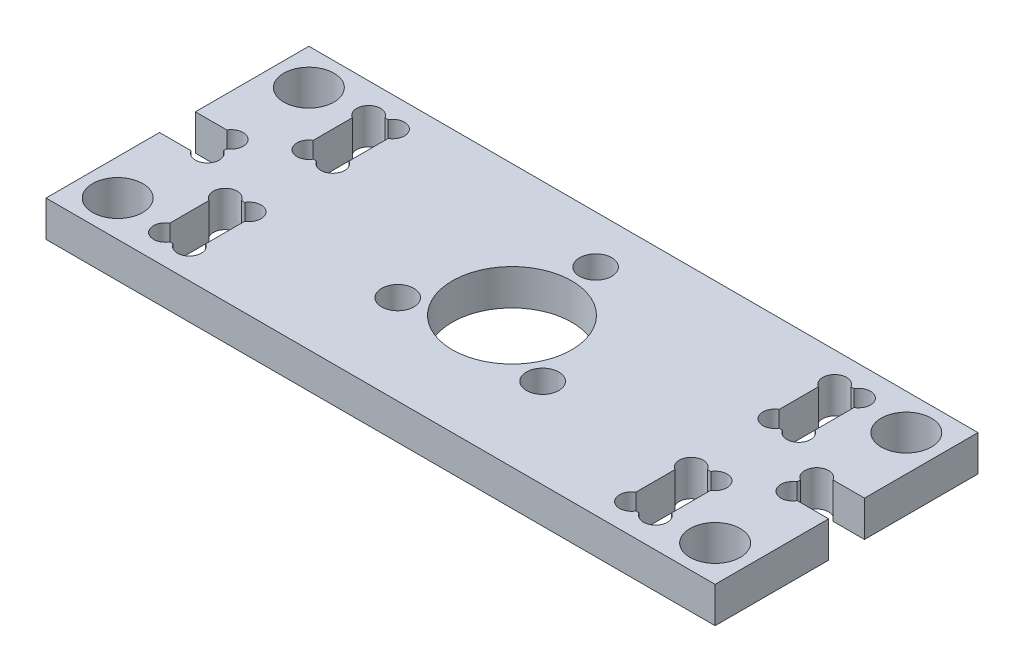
ISO-10303-21;
HEADER;
FILE_DESCRIPTION(('STEP AP214'),'2;1');
FILE_NAME('part.step','',(''),(''),'','','');
FILE_SCHEMA(('AUTOMOTIVE_DESIGN { 1 0 10303 214 1 1 1 1 }'));
ENDSEC;
DATA;
#1=APPLICATION_CONTEXT('core data for automotive mechanical design processes');
#2=APPLICATION_PROTOCOL_DEFINITION('international standard','automotive_design',2000,#1);
#3=PRODUCT_CONTEXT('',#1,'mechanical');
#4=PRODUCT('Part','Part','',(#3));
#5=PRODUCT_RELATED_PRODUCT_CATEGORY('part','',(#4));
#6=PRODUCT_DEFINITION_FORMATION('','',#4);
#7=PRODUCT_DEFINITION_CONTEXT('part definition',#1,'design');
#8=PRODUCT_DEFINITION('design','',#6,#7);
#9=PRODUCT_DEFINITION_SHAPE('','',#8);
#10=(LENGTH_UNIT() NAMED_UNIT(*) SI_UNIT(.MILLI.,.METRE.));
#11=(NAMED_UNIT(*) PLANE_ANGLE_UNIT() SI_UNIT($,.RADIAN.));
#12=(NAMED_UNIT(*) SI_UNIT($,.STERADIAN.) SOLID_ANGLE_UNIT());
#13=UNCERTAINTY_MEASURE_WITH_UNIT(LENGTH_MEASURE(1.E-05),#10,'distance_accuracy_value','');
#14=(GEOMETRIC_REPRESENTATION_CONTEXT(3) GLOBAL_UNCERTAINTY_ASSIGNED_CONTEXT((#13)) GLOBAL_UNIT_ASSIGNED_CONTEXT((#10,
#11,#12)) REPRESENTATION_CONTEXT('',''));
#15=CARTESIAN_POINT('',(0.,0.,0.));
#16=DIRECTION('',(0.,0.,1.));
#17=DIRECTION('',(1.,0.,0.));
#18=AXIS2_PLACEMENT_3D('',#15,#16,#17);
#19=CARTESIAN_POINT('',(0.,3.,0.));
#20=DIRECTION('',(0.,-1.,0.));
#21=DIRECTION('',(0.,0.,-1.));
#22=AXIS2_PLACEMENT_3D('',#19,#20,#21);
#23=PLANE('',#22);
#24=CARTESIAN_POINT('',(0.,3.,-7.));
#25=DIRECTION('',(0.,1.,0.));
#26=DIRECTION('',(0.,0.,1.));
#27=AXIS2_PLACEMENT_3D('',#24,#25,#26);
#28=CIRCLE('',#27,1.35);
#29=CARTESIAN_POINT('',(0.,3.,-5.65));
#30=VERTEX_POINT('',#29);
#31=EDGE_CURVE('E1066',#30,#30,#28,.T.);
#32=ORIENTED_EDGE('',*,*,#31,.F.);
#33=EDGE_LOOP('',(#32));
#34=FACE_BOUND('',#33,.T.);
#35=CARTESIAN_POINT('',(6.06217782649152,3.,3.49999999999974));
#36=DIRECTION('',(0.,1.,0.));
#37=DIRECTION('',(0.,0.,1.));
#38=AXIS2_PLACEMENT_3D('',#35,#36,#37);
#39=CIRCLE('',#38,1.35);
#40=CARTESIAN_POINT('',(6.06217782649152,3.,4.84999999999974));
#41=VERTEX_POINT('',#40);
#42=EDGE_CURVE('E1068',#41,#41,#39,.T.);
#43=ORIENTED_EDGE('',*,*,#42,.F.);
#44=EDGE_LOOP('',(#43));
#45=FACE_BOUND('',#44,.T.);
#46=CARTESIAN_POINT('',(0.,3.,0.));
#47=DIRECTION('',(0.,1.,0.));
#48=DIRECTION('',(0.,0.,1.));
#49=AXIS2_PLACEMENT_3D('',#46,#47,#48);
#50=CIRCLE('',#49,5.);
#51=CARTESIAN_POINT('',(0.,3.,5.));
#52=VERTEX_POINT('',#51);
#53=EDGE_CURVE('E361',#52,#52,#50,.T.);
#54=ORIENTED_EDGE('',*,*,#53,.F.);
#55=EDGE_LOOP('',(#54));
#56=FACE_BOUND('',#55,.T.);
#57=CARTESIAN_POINT('',(-25.,3.,-8.));
#58=DIRECTION('',(0.,1.,0.));
#59=DIRECTION('',(0.,0.,1.));
#60=AXIS2_PLACEMENT_3D('',#57,#58,#59);
#61=CIRCLE('',#60,2.1);
#62=CARTESIAN_POINT('',(-25.,3.,-5.9));
#63=VERTEX_POINT('',#62);
#64=EDGE_CURVE('E383',#63,#63,#61,.T.);
#65=ORIENTED_EDGE('',*,*,#64,.F.);
#66=EDGE_LOOP('',(#65));
#67=FACE_BOUND('',#66,.T.);
#68=CARTESIAN_POINT('',(25.,3.,-8.00000000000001));
#69=DIRECTION('',(0.,1.,0.));
#70=DIRECTION('',(0.,0.,1.));
#71=AXIS2_PLACEMENT_3D('',#68,#69,#70);
#72=CIRCLE('',#71,2.1);
#73=CARTESIAN_POINT('',(25.,3.,-5.90000000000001));
#74=VERTEX_POINT('',#73);
#75=EDGE_CURVE('E390',#74,#74,#72,.T.);
#76=ORIENTED_EDGE('',*,*,#75,.F.);
#77=EDGE_LOOP('',(#76));
#78=FACE_BOUND('',#77,.T.);
#79=CARTESIAN_POINT('',(25.,3.,8.00000000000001));
#80=DIRECTION('',(0.,1.,0.));
#81=DIRECTION('',(0.,0.,1.));
#82=AXIS2_PLACEMENT_3D('',#79,#80,#81);
#83=CIRCLE('',#82,2.1);
#84=CARTESIAN_POINT('',(25.,3.,10.1));
#85=VERTEX_POINT('',#84);
#86=EDGE_CURVE('E396',#85,#85,#83,.T.);
#87=ORIENTED_EDGE('',*,*,#86,.F.);
#88=EDGE_LOOP('',(#87));
#89=FACE_BOUND('',#88,.T.);
#90=CARTESIAN_POINT('',(-25.,3.,8.00000000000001));
#91=DIRECTION('',(0.,1.,0.));
#92=DIRECTION('',(0.,0.,1.));
#93=AXIS2_PLACEMENT_3D('',#90,#91,#92);
#94=CIRCLE('',#93,2.1);
#95=CARTESIAN_POINT('',(-25.,3.,10.1));
#96=VERTEX_POINT('',#95);
#97=EDGE_CURVE('E402',#96,#96,#94,.T.);
#98=ORIENTED_EDGE('',*,*,#97,.F.);
#99=EDGE_LOOP('',(#98));
#100=FACE_BOUND('',#99,.T.);
#101=CARTESIAN_POINT('',(20.5,3.,-3.49999999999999));
#102=DIRECTION('',(0.,1.,0.));
#103=DIRECTION('',(0.,0.,1.));
#104=AXIS2_PLACEMENT_3D('',#101,#102,#103);
#105=CIRCLE('',#104,0.999999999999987);
#106=CARTESIAN_POINT('',(19.6339745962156,3.,-3.));
#107=VERTEX_POINT('',#106);
#108=CARTESIAN_POINT('',(21.,3.,-4.36602540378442));
#109=VERTEX_POINT('',#108);
#110=EDGE_CURVE('E737',#107,#109,#105,.T.);
#111=ORIENTED_EDGE('',*,*,#110,.F.);
#112=DIRECTION('',(1.,0.,0.));
#113=VECTOR('',#112,1.);
#114=CARTESIAN_POINT('',(21.,3.,-3.00000000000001));
#115=LINE('',#114,#113);
#116=CARTESIAN_POINT('',(19.3660254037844,3.,-3.));
#117=VERTEX_POINT('',#116);
#118=EDGE_CURVE('E549',#117,#107,#115,.T.);
#119=ORIENTED_EDGE('',*,*,#118,.F.);
#120=CARTESIAN_POINT('',(18.5,3.,-3.49999999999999));
#121=DIRECTION('',(0.,1.,0.));
#122=DIRECTION('',(0.,0.,1.));
#123=AXIS2_PLACEMENT_3D('',#120,#121,#122);
#124=CIRCLE('',#123,0.999999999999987);
#125=CARTESIAN_POINT('',(18.,3.,-4.36602540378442));
#126=VERTEX_POINT('',#125);
#127=EDGE_CURVE('E449',#126,#117,#124,.T.);
#128=ORIENTED_EDGE('',*,*,#127,.F.);
#129=DIRECTION('',(0.,0.,1.));
#130=VECTOR('',#129,1.);
#131=CARTESIAN_POINT('',(18.,3.,-9.00000000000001));
#132=LINE('',#131,#130);
#133=CARTESIAN_POINT('',(18.,3.,-7.63397459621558));
#134=VERTEX_POINT('',#133);
#135=EDGE_CURVE('E545',#134,#126,#132,.T.);
#136=ORIENTED_EDGE('',*,*,#135,.F.);
#137=CARTESIAN_POINT('',(18.5,3.,-8.50000000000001));
#138=DIRECTION('',(0.,1.,0.));
#139=DIRECTION('',(0.,0.,1.));
#140=AXIS2_PLACEMENT_3D('',#137,#138,#139);
#141=CIRCLE('',#140,0.999999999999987);
#142=CARTESIAN_POINT('',(19.3660254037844,3.,-9.00000000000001));
#143=VERTEX_POINT('',#142);
#144=EDGE_CURVE('E466',#143,#134,#141,.T.);
#145=ORIENTED_EDGE('',*,*,#144,.F.);
#146=DIRECTION('',(-1.,0.,0.));
#147=VECTOR('',#146,1.);
#148=CARTESIAN_POINT('',(21.,3.,-9.00000000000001));
#149=LINE('',#148,#147);
#150=CARTESIAN_POINT('',(19.6339745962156,3.,-9.00000000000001));
#151=VERTEX_POINT('',#150);
#152=EDGE_CURVE('E542',#151,#143,#149,.T.);
#153=ORIENTED_EDGE('',*,*,#152,.F.);
#154=CARTESIAN_POINT('',(20.5,3.,-8.50000000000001));
#155=DIRECTION('',(0.,1.,0.));
#156=DIRECTION('',(0.,0.,1.));
#157=AXIS2_PLACEMENT_3D('',#154,#155,#156);
#158=CIRCLE('',#157,0.999999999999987);
#159=CARTESIAN_POINT('',(21.,3.,-7.63397459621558));
#160=VERTEX_POINT('',#159);
#161=EDGE_CURVE('E477',#160,#151,#158,.T.);
#162=ORIENTED_EDGE('',*,*,#161,.F.);
#163=DIRECTION('',(0.,0.,-1.));
#164=VECTOR('',#163,1.);
#165=CARTESIAN_POINT('',(21.,3.,-9.00000000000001));
#166=LINE('',#165,#164);
#167=EDGE_CURVE('E537',#109,#160,#166,.T.);
#168=ORIENTED_EDGE('',*,*,#167,.F.);
#169=EDGE_LOOP('',(#111,#119,#128,#136,#145,#153,#162,#168));
#170=FACE_BOUND('',#169,.T.);
#171=CARTESIAN_POINT('',(20.5,3.,8.50000000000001));
#172=DIRECTION('',(0.,1.,0.));
#173=DIRECTION('',(0.,0.,1.));
#174=AXIS2_PLACEMENT_3D('',#171,#172,#173);
#175=CIRCLE('',#174,0.999999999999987);
#176=CARTESIAN_POINT('',(19.6339745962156,3.,9.00000000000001));
#177=VERTEX_POINT('',#176);
#178=CARTESIAN_POINT('',(21.,3.,7.63397459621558));
#179=VERTEX_POINT('',#178);
#180=EDGE_CURVE('E688',#177,#179,#175,.T.);
#181=ORIENTED_EDGE('',*,*,#180,.F.);
#182=DIRECTION('',(1.,0.,0.));
#183=VECTOR('',#182,1.);
#184=CARTESIAN_POINT('',(21.,3.,9.00000000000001));
#185=LINE('',#184,#183);
#186=CARTESIAN_POINT('',(19.3660254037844,3.,9.00000000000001));
#187=VERTEX_POINT('',#186);
#188=EDGE_CURVE('E514',#187,#177,#185,.T.);
#189=ORIENTED_EDGE('',*,*,#188,.F.);
#190=CARTESIAN_POINT('',(18.5,3.,8.50000000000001));
#191=DIRECTION('',(0.,1.,0.));
#192=DIRECTION('',(0.,0.,1.));
#193=AXIS2_PLACEMENT_3D('',#190,#191,#192);
#194=CIRCLE('',#193,0.999999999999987);
#195=CARTESIAN_POINT('',(18.,3.,7.63397459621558));
#196=VERTEX_POINT('',#195);
#197=EDGE_CURVE('E699',#196,#187,#194,.T.);
#198=ORIENTED_EDGE('',*,*,#197,.F.);
#199=DIRECTION('',(0.,0.,1.));
#200=VECTOR('',#199,1.);
#201=CARTESIAN_POINT('',(18.,3.,9.00000000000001));
#202=LINE('',#201,#200);
#203=CARTESIAN_POINT('',(18.,3.,4.36602540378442));
#204=VERTEX_POINT('',#203);
#205=EDGE_CURVE('E528',#204,#196,#202,.T.);
#206=ORIENTED_EDGE('',*,*,#205,.F.);
#207=CARTESIAN_POINT('',(18.5,3.,3.49999999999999));
#208=DIRECTION('',(0.,1.,0.));
#209=DIRECTION('',(0.,0.,1.));
#210=AXIS2_PLACEMENT_3D('',#207,#208,#209);
#211=CIRCLE('',#210,0.999999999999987);
#212=CARTESIAN_POINT('',(19.3660254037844,3.,3.));
#213=VERTEX_POINT('',#212);
#214=EDGE_CURVE('E710',#213,#204,#211,.T.);
#215=ORIENTED_EDGE('',*,*,#214,.F.);
#216=DIRECTION('',(-1.,0.,0.));
#217=VECTOR('',#216,1.);
#218=CARTESIAN_POINT('',(21.,3.,3.00000000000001));
#219=LINE('',#218,#217);
#220=CARTESIAN_POINT('',(19.6339745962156,3.,3.));
#221=VERTEX_POINT('',#220);
#222=EDGE_CURVE('E524',#221,#213,#219,.T.);
#223=ORIENTED_EDGE('',*,*,#222,.F.);
#224=CARTESIAN_POINT('',(20.5,3.,3.49999999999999));
#225=DIRECTION('',(0.,1.,0.));
#226=DIRECTION('',(0.,0.,1.));
#227=AXIS2_PLACEMENT_3D('',#224,#225,#226);
#228=CIRCLE('',#227,0.999999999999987);
#229=CARTESIAN_POINT('',(21.,3.,4.36602540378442));
#230=VERTEX_POINT('',#229);
#231=EDGE_CURVE('E721',#230,#221,#228,.T.);
#232=ORIENTED_EDGE('',*,*,#231,.F.);
#233=DIRECTION('',(0.,0.,-1.));
#234=VECTOR('',#233,1.);
#235=CARTESIAN_POINT('',(21.,3.,9.00000000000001));
#236=LINE('',#235,#234);
#237=EDGE_CURVE('E522',#179,#230,#236,.T.);
#238=ORIENTED_EDGE('',*,*,#237,.F.);
#239=EDGE_LOOP('',(#181,#189,#198,#206,#215,#223,#232,#238));
#240=FACE_BOUND('',#239,.T.);
#241=CARTESIAN_POINT('',(-20.5,3.,3.5));
#242=DIRECTION('',(0.,1.,0.));
#243=DIRECTION('',(0.,0.,1.));
#244=AXIS2_PLACEMENT_3D('',#241,#242,#243);
#245=CIRCLE('',#244,0.999999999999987);
#246=CARTESIAN_POINT('',(-19.6339745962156,3.,3.));
#247=VERTEX_POINT('',#246);
#248=CARTESIAN_POINT('',(-21.,3.,4.36602540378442));
#249=VERTEX_POINT('',#248);
#250=EDGE_CURVE('E644',#247,#249,#245,.T.);
#251=ORIENTED_EDGE('',*,*,#250,.F.);
#252=DIRECTION('',(-1.,0.,0.));
#253=VECTOR('',#252,1.);
#254=CARTESIAN_POINT('',(-21.,3.,3.));
#255=LINE('',#254,#253);
#256=CARTESIAN_POINT('',(-19.3660254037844,3.,3.));
#257=VERTEX_POINT('',#256);
#258=EDGE_CURVE('E507',#257,#247,#255,.T.);
#259=ORIENTED_EDGE('',*,*,#258,.F.);
#260=CARTESIAN_POINT('',(-18.5,3.,3.5));
#261=DIRECTION('',(0.,1.,0.));
#262=DIRECTION('',(0.,0.,1.));
#263=AXIS2_PLACEMENT_3D('',#260,#261,#262);
#264=CIRCLE('',#263,0.999999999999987);
#265=CARTESIAN_POINT('',(-18.,3.,4.36602540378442));
#266=VERTEX_POINT('',#265);
#267=EDGE_CURVE('E655',#266,#257,#264,.T.);
#268=ORIENTED_EDGE('',*,*,#267,.F.);
#269=DIRECTION('',(0.,0.,-1.));
#270=VECTOR('',#269,1.);
#271=CARTESIAN_POINT('',(-18.,3.,9.));
#272=LINE('',#271,#270);
#273=CARTESIAN_POINT('',(-18.,3.,7.63397459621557));
#274=VERTEX_POINT('',#273);
#275=EDGE_CURVE('E503',#274,#266,#272,.T.);
#276=ORIENTED_EDGE('',*,*,#275,.F.);
#277=CARTESIAN_POINT('',(-18.5,3.,8.5));
#278=DIRECTION('',(0.,1.,0.));
#279=DIRECTION('',(0.,0.,1.));
#280=AXIS2_PLACEMENT_3D('',#277,#278,#279);
#281=CIRCLE('',#280,0.999999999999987);
#282=CARTESIAN_POINT('',(-19.3660254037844,3.,9.));
#283=VERTEX_POINT('',#282);
#284=EDGE_CURVE('E666',#283,#274,#281,.T.);
#285=ORIENTED_EDGE('',*,*,#284,.F.);
#286=DIRECTION('',(1.,0.,0.));
#287=VECTOR('',#286,1.);
#288=CARTESIAN_POINT('',(-21.,3.,9.));
#289=LINE('',#288,#287);
#290=CARTESIAN_POINT('',(-19.6339745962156,3.,9.));
#291=VERTEX_POINT('',#290);
#292=EDGE_CURVE('E500',#291,#283,#289,.T.);
#293=ORIENTED_EDGE('',*,*,#292,.F.);
#294=CARTESIAN_POINT('',(-20.5,3.,8.5));
#295=DIRECTION('',(0.,1.,0.));
#296=DIRECTION('',(0.,0.,1.));
#297=AXIS2_PLACEMENT_3D('',#294,#295,#296);
#298=CIRCLE('',#297,0.999999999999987);
#299=CARTESIAN_POINT('',(-21.,3.,7.63397459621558));
#300=VERTEX_POINT('',#299);
#301=EDGE_CURVE('E671',#300,#291,#298,.T.);
#302=ORIENTED_EDGE('',*,*,#301,.F.);
#303=DIRECTION('',(0.,0.,1.));
#304=VECTOR('',#303,1.);
#305=CARTESIAN_POINT('',(-21.,3.,9.));
#306=LINE('',#305,#304);
#307=EDGE_CURVE('E493',#249,#300,#306,.T.);
#308=ORIENTED_EDGE('',*,*,#307,.F.);
#309=EDGE_LOOP('',(#251,#259,#268,#276,#285,#293,#302,#308));
#310=FACE_BOUND('',#309,.T.);
#311=CARTESIAN_POINT('',(-24.5,3.,-1.));
#312=DIRECTION('',(0.,1.,0.));
#313=DIRECTION('',(0.,0.,1.));
#314=AXIS2_PLACEMENT_3D('',#311,#312,#313);
#315=CIRCLE('',#314,0.999999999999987);
#316=CARTESIAN_POINT('',(-24.,3.,-0.133974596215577));
#317=VERTEX_POINT('',#316);
#318=CARTESIAN_POINT('',(-25.3660254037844,3.,-1.5));
#319=VERTEX_POINT('',#318);
#320=EDGE_CURVE('E622',#317,#319,#315,.T.);
#321=ORIENTED_EDGE('',*,*,#320,.F.);
#322=DIRECTION('',(0.,0.,-1.));
#323=VECTOR('',#322,1.);
#324=CARTESIAN_POINT('',(-24.,3.,-1.5));
#325=LINE('',#324,#323);
#326=CARTESIAN_POINT('',(-24.,3.,0.133974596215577));
#327=VERTEX_POINT('',#326);
#328=EDGE_CURVE('E566',#327,#317,#325,.T.);
#329=ORIENTED_EDGE('',*,*,#328,.F.);
#330=CARTESIAN_POINT('',(-24.5,3.,1.));
#331=DIRECTION('',(0.,1.,0.));
#332=DIRECTION('',(0.,0.,1.));
#333=AXIS2_PLACEMENT_3D('',#330,#331,#332);
#334=CIRCLE('',#333,0.999999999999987);
#335=CARTESIAN_POINT('',(-25.3660254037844,3.,1.5));
#336=VERTEX_POINT('',#335);
#337=EDGE_CURVE('E633',#336,#327,#334,.T.);
#338=ORIENTED_EDGE('',*,*,#337,.F.);
#339=DIRECTION('',(1.,0.,0.));
#340=VECTOR('',#339,1.);
#341=CARTESIAN_POINT('',(-28.,3.,1.5));
#342=LINE('',#341,#340);
#343=CARTESIAN_POINT('',(-28.,3.,1.5));
#344=VERTEX_POINT('',#343);
#345=EDGE_CURVE('E563',#344,#336,#342,.T.);
#346=ORIENTED_EDGE('',*,*,#345,.F.);
#347=DIRECTION('',(0.,0.,1.));
#348=VECTOR('',#347,1.);
#349=CARTESIAN_POINT('',(-28.,3.,11.));
#350=LINE('',#349,#348);
#351=CARTESIAN_POINT('',(-28.,3.,11.));
#352=VERTEX_POINT('',#351);
#353=EDGE_CURVE('E415',#344,#352,#350,.T.);
#354=ORIENTED_EDGE('',*,*,#353,.T.);
#355=DIRECTION('',(1.,0.,0.));
#356=VECTOR('',#355,1.);
#357=CARTESIAN_POINT('',(-28.,3.,11.));
#358=LINE('',#357,#356);
#359=CARTESIAN_POINT('',(28.,3.,11.));
#360=VERTEX_POINT('',#359);
#361=EDGE_CURVE('E419',#352,#360,#358,.T.);
#362=ORIENTED_EDGE('',*,*,#361,.T.);
#363=DIRECTION('',(0.,0.,-1.));
#364=VECTOR('',#363,1.);
#365=CARTESIAN_POINT('',(28.,3.,11.));
#366=LINE('',#365,#364);
#367=CARTESIAN_POINT('',(28.,3.,1.50000000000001));
#368=VERTEX_POINT('',#367);
#369=EDGE_CURVE('E409',#360,#368,#366,.T.);
#370=ORIENTED_EDGE('',*,*,#369,.T.);
#371=DIRECTION('',(1.,0.,0.));
#372=VECTOR('',#371,1.);
#373=CARTESIAN_POINT('',(28.,3.,1.50000000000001));
#374=LINE('',#373,#372);
#375=CARTESIAN_POINT('',(25.3660254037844,3.,1.5));
#376=VERTEX_POINT('',#375);
#377=EDGE_CURVE('E578',#376,#368,#374,.T.);
#378=ORIENTED_EDGE('',*,*,#377,.F.);
#379=CARTESIAN_POINT('',(24.5,3.,1.00000000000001));
#380=DIRECTION('',(0.,1.,0.));
#381=DIRECTION('',(0.,0.,1.));
#382=AXIS2_PLACEMENT_3D('',#379,#380,#381);
#383=CIRCLE('',#382,0.999999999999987);
#384=CARTESIAN_POINT('',(24.,3.,0.133974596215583));
#385=VERTEX_POINT('',#384);
#386=EDGE_CURVE('E732',#385,#376,#383,.T.);
#387=ORIENTED_EDGE('',*,*,#386,.F.);
#388=DIRECTION('',(0.,0.,1.));
#389=VECTOR('',#388,1.);
#390=CARTESIAN_POINT('',(24.,3.,-1.49999999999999));
#391=LINE('',#390,#389);
#392=CARTESIAN_POINT('',(24.,3.,-0.133974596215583));
#393=VERTEX_POINT('',#392);
#394=EDGE_CURVE('E586',#393,#385,#391,.T.);
#395=ORIENTED_EDGE('',*,*,#394,.F.);
#396=CARTESIAN_POINT('',(24.5,3.,-1.00000000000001));
#397=DIRECTION('',(0.,1.,0.));
#398=DIRECTION('',(0.,0.,1.));
#399=AXIS2_PLACEMENT_3D('',#396,#397,#398);
#400=CIRCLE('',#399,0.999999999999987);
#401=CARTESIAN_POINT('',(25.3660254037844,3.,-1.5));
#402=VERTEX_POINT('',#401);
#403=EDGE_CURVE('E743',#402,#393,#400,.T.);
#404=ORIENTED_EDGE('',*,*,#403,.F.);
#405=DIRECTION('',(-1.,0.,0.));
#406=VECTOR('',#405,1.);
#407=CARTESIAN_POINT('',(28.,3.,-1.50000000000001));
#408=LINE('',#407,#406);
#409=CARTESIAN_POINT('',(28.,3.,-1.50000000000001));
#410=VERTEX_POINT('',#409);
#411=EDGE_CURVE('E488',#410,#402,#408,.T.);
#412=ORIENTED_EDGE('',*,*,#411,.F.);
#413=CARTESIAN_POINT('',(28.,3.,-11.));
#414=VERTEX_POINT('',#413);
#415=EDGE_CURVE('E413',#410,#414,#366,.T.);
#416=ORIENTED_EDGE('',*,*,#415,.T.);
#417=DIRECTION('',(-1.,0.,0.));
#418=VECTOR('',#417,1.);
#419=CARTESIAN_POINT('',(-28.,3.,-11.));
#420=LINE('',#419,#418);
#421=CARTESIAN_POINT('',(-28.,3.,-11.));
#422=VERTEX_POINT('',#421);
#423=EDGE_CURVE('E412',#414,#422,#420,.T.);
#424=ORIENTED_EDGE('',*,*,#423,.T.);
#425=CARTESIAN_POINT('',(-28.,3.,-1.5));
#426=VERTEX_POINT('',#425);
#427=EDGE_CURVE('E416',#422,#426,#350,.T.);
#428=ORIENTED_EDGE('',*,*,#427,.T.);
#429=DIRECTION('',(-1.,0.,0.));
#430=VECTOR('',#429,1.);
#431=CARTESIAN_POINT('',(-28.,3.,-1.5));
#432=LINE('',#431,#430);
#433=EDGE_CURVE('E557',#319,#426,#432,.T.);
#434=ORIENTED_EDGE('',*,*,#433,.F.);
#435=EDGE_LOOP('',(#321,#329,#338,#346,#354,#362,#370,#378,#387,#395,#404,#412,#416,#424,#428,#434));
#436=FACE_BOUND('',#435,.T.);
#437=CARTESIAN_POINT('',(-20.5,3.,-8.5));
#438=DIRECTION('',(0.,1.,0.));
#439=DIRECTION('',(0.,0.,1.));
#440=AXIS2_PLACEMENT_3D('',#437,#438,#439);
#441=CIRCLE('',#440,0.999999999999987);
#442=CARTESIAN_POINT('',(-19.6339745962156,3.,-9.));
#443=VERTEX_POINT('',#442);
#444=CARTESIAN_POINT('',(-21.,3.,-7.63397459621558));
#445=VERTEX_POINT('',#444);
#446=EDGE_CURVE('E347',#443,#445,#441,.T.);
#447=ORIENTED_EDGE('',*,*,#446,.F.);
#448=DIRECTION('',(-1.,0.,0.));
#449=VECTOR('',#448,1.);
#450=CARTESIAN_POINT('',(-21.,3.,-9.));
#451=LINE('',#450,#449);
#452=CARTESIAN_POINT('',(-19.3660254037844,3.,-9.));
#453=VERTEX_POINT('',#452);
#454=EDGE_CURVE('E355',#453,#443,#451,.T.);
#455=ORIENTED_EDGE('',*,*,#454,.F.);
#456=CARTESIAN_POINT('',(-18.5,3.,-8.5));
#457=DIRECTION('',(0.,1.,0.));
#458=DIRECTION('',(0.,0.,1.));
#459=AXIS2_PLACEMENT_3D('',#456,#457,#458);
#460=CIRCLE('',#459,0.999999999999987);
#461=CARTESIAN_POINT('',(-18.,3.,-7.63397459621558));
#462=VERTEX_POINT('',#461);
#463=EDGE_CURVE('E1084',#462,#453,#460,.T.);
#464=ORIENTED_EDGE('',*,*,#463,.F.);
#465=DIRECTION('',(0.,0.,-1.));
#466=VECTOR('',#465,1.);
#467=CARTESIAN_POINT('',(-18.,3.,-9.));
#468=LINE('',#467,#466);
#469=CARTESIAN_POINT('',(-18.,3.,-4.36602540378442));
#470=VERTEX_POINT('',#469);
#471=EDGE_CURVE('E377',#470,#462,#468,.T.);
#472=ORIENTED_EDGE('',*,*,#471,.F.);
#473=CARTESIAN_POINT('',(-18.5,3.,-3.5));
#474=DIRECTION('',(0.,1.,0.));
#475=DIRECTION('',(0.,0.,1.));
#476=AXIS2_PLACEMENT_3D('',#473,#474,#475);
#477=CIRCLE('',#476,0.999999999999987);
#478=CARTESIAN_POINT('',(-19.3660254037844,3.,-3.));
#479=VERTEX_POINT('',#478);
#480=EDGE_CURVE('E608',#479,#470,#477,.T.);
#481=ORIENTED_EDGE('',*,*,#480,.F.);
#482=DIRECTION('',(1.,0.,0.));
#483=VECTOR('',#482,1.);
#484=CARTESIAN_POINT('',(-21.,3.,-3.));
#485=LINE('',#484,#483);
#486=CARTESIAN_POINT('',(-19.6339745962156,3.,-3.));
#487=VERTEX_POINT('',#486);
#488=EDGE_CURVE('E373',#487,#479,#485,.T.);
#489=ORIENTED_EDGE('',*,*,#488,.F.);
#490=CARTESIAN_POINT('',(-20.5,3.,-3.5));
#491=DIRECTION('',(0.,1.,0.));
#492=DIRECTION('',(0.,0.,1.));
#493=AXIS2_PLACEMENT_3D('',#490,#491,#492);
#494=CIRCLE('',#493,0.999999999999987);
#495=CARTESIAN_POINT('',(-21.,3.,-4.36602540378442));
#496=VERTEX_POINT('',#495);
#497=EDGE_CURVE('E611',#496,#487,#494,.T.);
#498=ORIENTED_EDGE('',*,*,#497,.F.);
#499=DIRECTION('',(0.,0.,1.));
#500=VECTOR('',#499,1.);
#501=CARTESIAN_POINT('',(-21.,3.,-9.));
#502=LINE('',#501,#500);
#503=EDGE_CURVE('E371',#445,#496,#502,.T.);
#504=ORIENTED_EDGE('',*,*,#503,.F.);
#505=EDGE_LOOP('',(#447,#455,#464,#472,#481,#489,#498,#504));
#506=FACE_BOUND('',#505,.T.);
#507=CARTESIAN_POINT('',(-6.06217782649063,3.,3.50000000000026));
#508=DIRECTION('',(0.,1.,0.));
#509=DIRECTION('',(0.,0.,1.));
#510=AXIS2_PLACEMENT_3D('',#507,#508,#509);
#511=CIRCLE('',#510,1.35);
#512=CARTESIAN_POINT('',(-6.06217782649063,3.,4.85000000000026));
#513=VERTEX_POINT('',#512);
#514=EDGE_CURVE('E1076',#513,#513,#511,.T.);
#515=ORIENTED_EDGE('',*,*,#514,.F.);
#516=EDGE_LOOP('',(#515));
#517=FACE_BOUND('',#516,.T.);
#518=ADVANCED_FACE('F35',(#34,#45,#56,#67,#78,#89,#100,#170,#240,#310,#436,#506,#517),#23,.F.);
#519=CARTESIAN_POINT('',(0.,0.,0.));
#520=DIRECTION('',(0.,-1.,0.));
#521=DIRECTION('',(0.,0.,-1.));
#522=AXIS2_PLACEMENT_3D('',#519,#520,#521);
#523=PLANE('',#522);
#524=CARTESIAN_POINT('',(0.,0.,-7.));
#525=DIRECTION('',(0.,1.,0.));
#526=DIRECTION('',(0.,0.,1.));
#527=AXIS2_PLACEMENT_3D('',#524,#525,#526);
#528=CIRCLE('',#527,1.35);
#529=CARTESIAN_POINT('',(0.,0.,-5.65));
#530=VERTEX_POINT('',#529);
#531=EDGE_CURVE('E1064',#530,#530,#528,.T.);
#532=ORIENTED_EDGE('',*,*,#531,.T.);
#533=EDGE_LOOP('',(#532));
#534=FACE_BOUND('',#533,.T.);
#535=CARTESIAN_POINT('',(6.06217782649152,0.,3.49999999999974));
#536=DIRECTION('',(0.,1.,0.));
#537=DIRECTION('',(0.,0.,1.));
#538=AXIS2_PLACEMENT_3D('',#535,#536,#537);
#539=CIRCLE('',#538,1.35);
#540=CARTESIAN_POINT('',(6.06217782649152,0.,4.84999999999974));
#541=VERTEX_POINT('',#540);
#542=EDGE_CURVE('E1073',#541,#541,#539,.T.);
#543=ORIENTED_EDGE('',*,*,#542,.T.);
#544=EDGE_LOOP('',(#543));
#545=FACE_BOUND('',#544,.T.);
#546=DIRECTION('',(-1.,0.,0.));
#547=VECTOR('',#546,1.);
#548=CARTESIAN_POINT('',(-21.,0.,-9.));
#549=LINE('',#548,#547);
#550=CARTESIAN_POINT('',(-19.3660254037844,0.,-9.));
#551=VERTEX_POINT('',#550);
#552=CARTESIAN_POINT('',(-19.6339745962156,0.,-9.));
#553=VERTEX_POINT('',#552);
#554=EDGE_CURVE('E353',#551,#553,#549,.T.);
#555=ORIENTED_EDGE('',*,*,#554,.T.);
#556=CARTESIAN_POINT('',(-20.5,0.,-8.5));
#557=DIRECTION('',(0.,1.,0.));
#558=DIRECTION('',(0.,0.,1.));
#559=AXIS2_PLACEMENT_3D('',#556,#557,#558);
#560=CIRCLE('',#559,1.);
#561=CARTESIAN_POINT('',(-21.,0.,-7.63397459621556));
#562=VERTEX_POINT('',#561);
#563=EDGE_CURVE('E339',#553,#562,#560,.T.);
#564=ORIENTED_EDGE('',*,*,#563,.T.);
#565=DIRECTION('',(0.,0.,1.));
#566=VECTOR('',#565,1.);
#567=CARTESIAN_POINT('',(-21.,0.,-9.));
#568=LINE('',#567,#566);
#569=CARTESIAN_POINT('',(-21.,0.,-4.36602540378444));
#570=VERTEX_POINT('',#569);
#571=EDGE_CURVE('E381',#562,#570,#568,.T.);
#572=ORIENTED_EDGE('',*,*,#571,.T.);
#573=CARTESIAN_POINT('',(-20.5,0.,-3.5));
#574=DIRECTION('',(0.,1.,0.));
#575=DIRECTION('',(0.,0.,1.));
#576=AXIS2_PLACEMENT_3D('',#573,#574,#575);
#577=CIRCLE('',#576,1.);
#578=CARTESIAN_POINT('',(-19.6339745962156,0.,-3.));
#579=VERTEX_POINT('',#578);
#580=EDGE_CURVE('E44',#570,#579,#577,.T.);
#581=ORIENTED_EDGE('',*,*,#580,.T.);
#582=DIRECTION('',(1.,0.,0.));
#583=VECTOR('',#582,1.);
#584=CARTESIAN_POINT('',(-21.,0.,-3.));
#585=LINE('',#584,#583);
#586=CARTESIAN_POINT('',(-19.3660254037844,0.,-3.));
#587=VERTEX_POINT('',#586);
#588=EDGE_CURVE('E367',#579,#587,#585,.T.);
#589=ORIENTED_EDGE('',*,*,#588,.T.);
#590=CARTESIAN_POINT('',(-18.5,0.,-3.5));
#591=DIRECTION('',(0.,1.,0.));
#592=DIRECTION('',(0.,0.,1.));
#593=AXIS2_PLACEMENT_3D('',#590,#591,#592);
#594=CIRCLE('',#593,1.);
#595=CARTESIAN_POINT('',(-18.,0.,-4.36602540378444));
#596=VERTEX_POINT('',#595);
#597=EDGE_CURVE('E11',#587,#596,#594,.T.);
#598=ORIENTED_EDGE('',*,*,#597,.T.);
#599=DIRECTION('',(0.,0.,-1.));
#600=VECTOR('',#599,1.);
#601=CARTESIAN_POINT('',(-18.,0.,-9.));
#602=LINE('',#601,#600);
#603=CARTESIAN_POINT('',(-18.,0.,-7.63397459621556));
#604=VERTEX_POINT('',#603);
#605=EDGE_CURVE('E362',#596,#604,#602,.T.);
#606=ORIENTED_EDGE('',*,*,#605,.T.);
#607=CARTESIAN_POINT('',(-18.5,0.,-8.5));
#608=DIRECTION('',(0.,1.,0.));
#609=DIRECTION('',(0.,0.,1.));
#610=AXIS2_PLACEMENT_3D('',#607,#608,#609);
#611=CIRCLE('',#610,1.);
#612=EDGE_CURVE('E360',#604,#551,#611,.T.);
#613=ORIENTED_EDGE('',*,*,#612,.T.);
#614=EDGE_LOOP('',(#555,#564,#572,#581,#589,#598,#606,#613));
#615=FACE_BOUND('',#614,.T.);
#616=DIRECTION('',(-1.,0.,0.));
#617=VECTOR('',#616,1.);
#618=CARTESIAN_POINT('',(-21.,0.,3.));
#619=LINE('',#618,#617);
#620=CARTESIAN_POINT('',(-19.3660254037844,0.,3.));
#621=VERTEX_POINT('',#620);
#622=CARTESIAN_POINT('',(-19.6339745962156,0.,3.));
#623=VERTEX_POINT('',#622);
#624=EDGE_CURVE('E496',#621,#623,#619,.T.);
#625=ORIENTED_EDGE('',*,*,#624,.T.);
#626=CARTESIAN_POINT('',(-20.5,0.,3.5));
#627=DIRECTION('',(0.,1.,0.));
#628=DIRECTION('',(0.,0.,1.));
#629=AXIS2_PLACEMENT_3D('',#626,#627,#628);
#630=CIRCLE('',#629,1.);
#631=CARTESIAN_POINT('',(-21.,0.,4.36602540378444));
#632=VERTEX_POINT('',#631);
#633=EDGE_CURVE('E646',#623,#632,#630,.T.);
#634=ORIENTED_EDGE('',*,*,#633,.T.);
#635=DIRECTION('',(0.,0.,1.));
#636=VECTOR('',#635,1.);
#637=CARTESIAN_POINT('',(-21.,0.,9.));
#638=LINE('',#637,#636);
#639=CARTESIAN_POINT('',(-21.,0.,7.63397459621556));
#640=VERTEX_POINT('',#639);
#641=EDGE_CURVE('E374',#632,#640,#638,.T.);
#642=ORIENTED_EDGE('',*,*,#641,.T.);
#643=CARTESIAN_POINT('',(-20.5,0.,8.5));
#644=DIRECTION('',(0.,1.,0.));
#645=DIRECTION('',(0.,0.,1.));
#646=AXIS2_PLACEMENT_3D('',#643,#644,#645);
#647=CIRCLE('',#646,1.);
#648=CARTESIAN_POINT('',(-19.6339745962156,0.,9.));
#649=VERTEX_POINT('',#648);
#650=EDGE_CURVE('E679',#640,#649,#647,.T.);
#651=ORIENTED_EDGE('',*,*,#650,.T.);
#652=DIRECTION('',(1.,0.,0.));
#653=VECTOR('',#652,1.);
#654=CARTESIAN_POINT('',(-21.,0.,9.));
#655=LINE('',#654,#653);
#656=CARTESIAN_POINT('',(-19.3660254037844,0.,9.));
#657=VERTEX_POINT('',#656);
#658=EDGE_CURVE('E489',#649,#657,#655,.T.);
#659=ORIENTED_EDGE('',*,*,#658,.T.);
#660=CARTESIAN_POINT('',(-18.5,0.,8.5));
#661=DIRECTION('',(0.,1.,0.));
#662=DIRECTION('',(0.,0.,1.));
#663=AXIS2_PLACEMENT_3D('',#660,#661,#662);
#664=CIRCLE('',#663,1.);
#665=CARTESIAN_POINT('',(-18.,0.,7.63397459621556));
#666=VERTEX_POINT('',#665);
#667=EDGE_CURVE('E638',#657,#666,#664,.T.);
#668=ORIENTED_EDGE('',*,*,#667,.T.);
#669=DIRECTION('',(0.,0.,-1.));
#670=VECTOR('',#669,1.);
#671=CARTESIAN_POINT('',(-18.,0.,9.));
#672=LINE('',#671,#670);
#673=CARTESIAN_POINT('',(-18.,0.,4.36602540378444));
#674=VERTEX_POINT('',#673);
#675=EDGE_CURVE('E492',#666,#674,#672,.T.);
#676=ORIENTED_EDGE('',*,*,#675,.T.);
#677=CARTESIAN_POINT('',(-18.5,0.,3.5));
#678=DIRECTION('',(0.,1.,0.));
#679=DIRECTION('',(0.,0.,1.));
#680=AXIS2_PLACEMENT_3D('',#677,#678,#679);
#681=CIRCLE('',#680,1.);
#682=EDGE_CURVE('E657',#674,#621,#681,.T.);
#683=ORIENTED_EDGE('',*,*,#682,.T.);
#684=EDGE_LOOP('',(#625,#634,#642,#651,#659,#668,#676,#683));
#685=FACE_BOUND('',#684,.T.);
#686=DIRECTION('',(1.,0.,0.));
#687=VECTOR('',#686,1.);
#688=CARTESIAN_POINT('',(21.,0.,9.00000000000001));
#689=LINE('',#688,#687);
#690=CARTESIAN_POINT('',(19.3660254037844,0.,9.00000000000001));
#691=VERTEX_POINT('',#690);
#692=CARTESIAN_POINT('',(19.6339745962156,0.,9.00000000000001));
#693=VERTEX_POINT('',#692);
#694=EDGE_CURVE('E504',#691,#693,#689,.T.);
#695=ORIENTED_EDGE('',*,*,#694,.T.);
#696=CARTESIAN_POINT('',(20.5,0.,8.50000000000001));
#697=DIRECTION('',(0.,1.,0.));
#698=DIRECTION('',(0.,0.,1.));
#699=AXIS2_PLACEMENT_3D('',#696,#697,#698);
#700=CIRCLE('',#699,1.);
#701=CARTESIAN_POINT('',(21.,0.,7.63397459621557));
#702=VERTEX_POINT('',#701);
#703=EDGE_CURVE('E682',#693,#702,#700,.T.);
#704=ORIENTED_EDGE('',*,*,#703,.T.);
#705=DIRECTION('',(0.,0.,-1.));
#706=VECTOR('',#705,1.);
#707=CARTESIAN_POINT('',(21.,0.,9.00000000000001));
#708=LINE('',#707,#706);
#709=CARTESIAN_POINT('',(21.,0.,4.36602540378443));
#710=VERTEX_POINT('',#709);
#711=EDGE_CURVE('E511',#702,#710,#708,.T.);
#712=ORIENTED_EDGE('',*,*,#711,.T.);
#713=CARTESIAN_POINT('',(20.5,0.,3.49999999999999));
#714=DIRECTION('',(0.,1.,0.));
#715=DIRECTION('',(0.,0.,1.));
#716=AXIS2_PLACEMENT_3D('',#713,#714,#715);
#717=CIRCLE('',#716,1.);
#718=CARTESIAN_POINT('',(19.6339745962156,0.,3.));
#719=VERTEX_POINT('',#718);
#720=EDGE_CURVE('E723',#710,#719,#717,.T.);
#721=ORIENTED_EDGE('',*,*,#720,.T.);
#722=DIRECTION('',(-1.,0.,0.));
#723=VECTOR('',#722,1.);
#724=CARTESIAN_POINT('',(21.,0.,3.00000000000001));
#725=LINE('',#724,#723);
#726=CARTESIAN_POINT('',(19.3660254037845,0.,3.00000000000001));
#727=VERTEX_POINT('',#726);
#728=EDGE_CURVE('E513',#719,#727,#725,.T.);
#729=ORIENTED_EDGE('',*,*,#728,.T.);
#730=CARTESIAN_POINT('',(18.5,0.,3.49999999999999));
#731=DIRECTION('',(0.,1.,0.));
#732=DIRECTION('',(0.,0.,1.));
#733=AXIS2_PLACEMENT_3D('',#730,#731,#732);
#734=CIRCLE('',#733,1.);
#735=CARTESIAN_POINT('',(18.,0.,4.36602540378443));
#736=VERTEX_POINT('',#735);
#737=EDGE_CURVE('E712',#727,#736,#734,.T.);
#738=ORIENTED_EDGE('',*,*,#737,.T.);
#739=DIRECTION('',(0.,0.,1.));
#740=VECTOR('',#739,1.);
#741=CARTESIAN_POINT('',(18.,0.,9.00000000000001));
#742=LINE('',#741,#740);
#743=CARTESIAN_POINT('',(18.,0.,7.63397459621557));
#744=VERTEX_POINT('',#743);
#745=EDGE_CURVE('E517',#736,#744,#742,.T.);
#746=ORIENTED_EDGE('',*,*,#745,.T.);
#747=CARTESIAN_POINT('',(18.5,0.,8.50000000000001));
#748=DIRECTION('',(0.,1.,0.));
#749=DIRECTION('',(0.,0.,1.));
#750=AXIS2_PLACEMENT_3D('',#747,#748,#749);
#751=CIRCLE('',#750,1.);
#752=EDGE_CURVE('E693',#744,#691,#751,.T.);
#753=ORIENTED_EDGE('',*,*,#752,.T.);
#754=EDGE_LOOP('',(#695,#704,#712,#721,#729,#738,#746,#753));
#755=FACE_BOUND('',#754,.T.);
#756=DIRECTION('',(1.,0.,0.));
#757=VECTOR('',#756,1.);
#758=CARTESIAN_POINT('',(21.,0.,-3.00000000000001));
#759=LINE('',#758,#757);
#760=CARTESIAN_POINT('',(19.3660254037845,0.,-3.));
#761=VERTEX_POINT('',#760);
#762=CARTESIAN_POINT('',(19.6339745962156,0.,-3.00000000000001));
#763=VERTEX_POINT('',#762);
#764=EDGE_CURVE('E539',#761,#763,#759,.T.);
#765=ORIENTED_EDGE('',*,*,#764,.T.);
#766=CARTESIAN_POINT('',(20.5,0.,-3.49999999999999));
#767=DIRECTION('',(0.,1.,0.));
#768=DIRECTION('',(0.,0.,1.));
#769=AXIS2_PLACEMENT_3D('',#766,#767,#768);
#770=CIRCLE('',#769,1.);
#771=CARTESIAN_POINT('',(21.,0.,-4.36602540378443));
#772=VERTEX_POINT('',#771);
#773=EDGE_CURVE('E455',#763,#772,#770,.T.);
#774=ORIENTED_EDGE('',*,*,#773,.T.);
#775=DIRECTION('',(0.,0.,-1.));
#776=VECTOR('',#775,1.);
#777=CARTESIAN_POINT('',(21.,0.,-9.00000000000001));
#778=LINE('',#777,#776);
#779=CARTESIAN_POINT('',(21.,0.,-7.63397459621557));
#780=VERTEX_POINT('',#779);
#781=EDGE_CURVE('E525',#772,#780,#778,.T.);
#782=ORIENTED_EDGE('',*,*,#781,.T.);
#783=CARTESIAN_POINT('',(20.5,0.,-8.50000000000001));
#784=DIRECTION('',(0.,1.,0.));
#785=DIRECTION('',(0.,0.,1.));
#786=AXIS2_PLACEMENT_3D('',#783,#784,#785);
#787=CIRCLE('',#786,1.);
#788=CARTESIAN_POINT('',(19.6339745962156,0.,-9.00000000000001));
#789=VERTEX_POINT('',#788);
#790=EDGE_CURVE('E479',#780,#789,#787,.T.);
#791=ORIENTED_EDGE('',*,*,#790,.T.);
#792=DIRECTION('',(-1.,0.,0.));
#793=VECTOR('',#792,1.);
#794=CARTESIAN_POINT('',(21.,0.,-9.00000000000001));
#795=LINE('',#794,#793);
#796=CARTESIAN_POINT('',(19.3660254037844,0.,-9.00000000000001));
#797=VERTEX_POINT('',#796);
#798=EDGE_CURVE('E533',#789,#797,#795,.T.);
#799=ORIENTED_EDGE('',*,*,#798,.T.);
#800=CARTESIAN_POINT('',(18.5,0.,-8.50000000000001));
#801=DIRECTION('',(0.,1.,0.));
#802=DIRECTION('',(0.,0.,1.));
#803=AXIS2_PLACEMENT_3D('',#800,#801,#802);
#804=CIRCLE('',#803,1.);
#805=CARTESIAN_POINT('',(18.,0.,-7.63397459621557));
#806=VERTEX_POINT('',#805);
#807=EDGE_CURVE('E468',#797,#806,#804,.T.);
#808=ORIENTED_EDGE('',*,*,#807,.T.);
#809=DIRECTION('',(0.,0.,1.));
#810=VECTOR('',#809,1.);
#811=CARTESIAN_POINT('',(18.,0.,-9.00000000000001));
#812=LINE('',#811,#810);
#813=CARTESIAN_POINT('',(18.,0.,-4.36602540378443));
#814=VERTEX_POINT('',#813);
#815=EDGE_CURVE('E536',#806,#814,#812,.T.);
#816=ORIENTED_EDGE('',*,*,#815,.T.);
#817=CARTESIAN_POINT('',(18.5,0.,-3.49999999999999));
#818=DIRECTION('',(0.,1.,0.));
#819=DIRECTION('',(0.,0.,1.));
#820=AXIS2_PLACEMENT_3D('',#817,#818,#819);
#821=CIRCLE('',#820,1.);
#822=EDGE_CURVE('E444',#814,#761,#821,.T.);
#823=ORIENTED_EDGE('',*,*,#822,.T.);
#824=EDGE_LOOP('',(#765,#774,#782,#791,#799,#808,#816,#823));
#825=FACE_BOUND('',#824,.T.);
#826=CARTESIAN_POINT('',(-25.,0.,8.00000000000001));
#827=DIRECTION('',(0.,1.,0.));
#828=DIRECTION('',(0.,0.,1.));
#829=AXIS2_PLACEMENT_3D('',#826,#827,#828);
#830=CIRCLE('',#829,2.1);
#831=CARTESIAN_POINT('',(-25.,0.,10.1));
#832=VERTEX_POINT('',#831);
#833=EDGE_CURVE('E405',#832,#832,#830,.T.);
#834=ORIENTED_EDGE('',*,*,#833,.T.);
#835=EDGE_LOOP('',(#834));
#836=FACE_BOUND('',#835,.T.);
#837=CARTESIAN_POINT('',(25.,0.,8.00000000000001));
#838=DIRECTION('',(0.,1.,0.));
#839=DIRECTION('',(0.,0.,1.));
#840=AXIS2_PLACEMENT_3D('',#837,#838,#839);
#841=CIRCLE('',#840,2.1);
#842=CARTESIAN_POINT('',(25.,0.,10.1));
#843=VERTEX_POINT('',#842);
#844=EDGE_CURVE('E399',#843,#843,#841,.T.);
#845=ORIENTED_EDGE('',*,*,#844,.T.);
#846=EDGE_LOOP('',(#845));
#847=FACE_BOUND('',#846,.T.);
#848=CARTESIAN_POINT('',(25.,0.,-8.00000000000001));
#849=DIRECTION('',(0.,1.,0.));
#850=DIRECTION('',(0.,0.,1.));
#851=AXIS2_PLACEMENT_3D('',#848,#849,#850);
#852=CIRCLE('',#851,2.1);
#853=CARTESIAN_POINT('',(25.,0.,-5.90000000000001));
#854=VERTEX_POINT('',#853);
#855=EDGE_CURVE('E393',#854,#854,#852,.T.);
#856=ORIENTED_EDGE('',*,*,#855,.T.);
#857=EDGE_LOOP('',(#856));
#858=FACE_BOUND('',#857,.T.);
#859=CARTESIAN_POINT('',(-25.,0.,-8.));
#860=DIRECTION('',(0.,1.,0.));
#861=DIRECTION('',(0.,0.,1.));
#862=AXIS2_PLACEMENT_3D('',#859,#860,#861);
#863=CIRCLE('',#862,2.1);
#864=CARTESIAN_POINT('',(-25.,0.,-5.9));
#865=VERTEX_POINT('',#864);
#866=EDGE_CURVE('E387',#865,#865,#863,.T.);
#867=ORIENTED_EDGE('',*,*,#866,.T.);
#868=EDGE_LOOP('',(#867));
#869=FACE_BOUND('',#868,.T.);
#870=CARTESIAN_POINT('',(0.,0.,0.));
#871=DIRECTION('',(0.,1.,0.));
#872=DIRECTION('',(0.,0.,1.));
#873=AXIS2_PLACEMENT_3D('',#870,#871,#872);
#874=CIRCLE('',#873,5.);
#875=CARTESIAN_POINT('',(0.,0.,5.));
#876=VERTEX_POINT('',#875);
#877=EDGE_CURVE('E365',#876,#876,#874,.T.);
#878=ORIENTED_EDGE('',*,*,#877,.T.);
#879=EDGE_LOOP('',(#878));
#880=FACE_BOUND('',#879,.T.);
#881=CARTESIAN_POINT('',(-24.5,0.,-1.));
#882=DIRECTION('',(0.,1.,0.));
#883=DIRECTION('',(0.,0.,1.));
#884=AXIS2_PLACEMENT_3D('',#881,#882,#883);
#885=CIRCLE('',#884,1.);
#886=CARTESIAN_POINT('',(-24.,0.,-0.133974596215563));
#887=VERTEX_POINT('',#886);
#888=CARTESIAN_POINT('',(-25.3660254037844,0.,-1.5));
#889=VERTEX_POINT('',#888);
#890=EDGE_CURVE('E624',#887,#889,#885,.T.);
#891=ORIENTED_EDGE('',*,*,#890,.T.);
#892=DIRECTION('',(-1.,0.,0.));
#893=VECTOR('',#892,1.);
#894=CARTESIAN_POINT('',(-28.,0.,-1.5));
#895=LINE('',#894,#893);
#896=CARTESIAN_POINT('',(-28.,0.,-1.5));
#897=VERTEX_POINT('',#896);
#898=EDGE_CURVE('E560',#889,#897,#895,.T.);
#899=ORIENTED_EDGE('',*,*,#898,.T.);
#900=DIRECTION('',(0.,0.,1.));
#901=VECTOR('',#900,1.);
#902=CARTESIAN_POINT('',(-28.,0.,11.));
#903=LINE('',#902,#901);
#904=CARTESIAN_POINT('',(-28.,0.,-11.));
#905=VERTEX_POINT('',#904);
#906=EDGE_CURVE('E428',#905,#897,#903,.T.);
#907=ORIENTED_EDGE('',*,*,#906,.F.);
#908=DIRECTION('',(-1.,0.,0.));
#909=VECTOR('',#908,1.);
#910=CARTESIAN_POINT('',(-28.,0.,-11.));
#911=LINE('',#910,#909);
#912=CARTESIAN_POINT('',(28.,0.,-11.));
#913=VERTEX_POINT('',#912);
#914=EDGE_CURVE('E425',#913,#905,#911,.T.);
#915=ORIENTED_EDGE('',*,*,#914,.F.);
#916=DIRECTION('',(0.,0.,-1.));
#917=VECTOR('',#916,1.);
#918=CARTESIAN_POINT('',(28.,0.,11.));
#919=LINE('',#918,#917);
#920=CARTESIAN_POINT('',(28.,0.,-1.50000000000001));
#921=VERTEX_POINT('',#920);
#922=EDGE_CURVE('E408',#921,#913,#919,.T.);
#923=ORIENTED_EDGE('',*,*,#922,.F.);
#924=DIRECTION('',(-1.,0.,0.));
#925=VECTOR('',#924,1.);
#926=CARTESIAN_POINT('',(28.,0.,-1.50000000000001));
#927=LINE('',#926,#925);
#928=CARTESIAN_POINT('',(25.3660254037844,0.,-1.5));
#929=VERTEX_POINT('',#928);
#930=EDGE_CURVE('E574',#921,#929,#927,.T.);
#931=ORIENTED_EDGE('',*,*,#930,.T.);
#932=CARTESIAN_POINT('',(24.5,0.,-1.00000000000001));
#933=DIRECTION('',(0.,1.,0.));
#934=DIRECTION('',(0.,0.,1.));
#935=AXIS2_PLACEMENT_3D('',#932,#933,#934);
#936=CIRCLE('',#935,1.);
#937=CARTESIAN_POINT('',(24.,0.,-0.133974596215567));
#938=VERTEX_POINT('',#937);
#939=EDGE_CURVE('E745',#929,#938,#936,.T.);
#940=ORIENTED_EDGE('',*,*,#939,.T.);
#941=DIRECTION('',(0.,0.,1.));
#942=VECTOR('',#941,1.);
#943=CARTESIAN_POINT('',(24.,0.,-1.49999999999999));
#944=LINE('',#943,#942);
#945=CARTESIAN_POINT('',(24.,0.,0.133974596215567));
#946=VERTEX_POINT('',#945);
#947=EDGE_CURVE('E577',#938,#946,#944,.T.);
#948=ORIENTED_EDGE('',*,*,#947,.T.);
#949=CARTESIAN_POINT('',(24.5,0.,1.00000000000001));
#950=DIRECTION('',(0.,1.,0.));
#951=DIRECTION('',(0.,0.,1.));
#952=AXIS2_PLACEMENT_3D('',#949,#950,#951);
#953=CIRCLE('',#952,1.);
#954=CARTESIAN_POINT('',(25.3660254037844,0.,1.5));
#955=VERTEX_POINT('',#954);
#956=EDGE_CURVE('E704',#946,#955,#953,.T.);
#957=ORIENTED_EDGE('',*,*,#956,.T.);
#958=DIRECTION('',(1.,0.,0.));
#959=VECTOR('',#958,1.);
#960=CARTESIAN_POINT('',(28.,0.,1.50000000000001));
#961=LINE('',#960,#959);
#962=CARTESIAN_POINT('',(28.,0.,1.50000000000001));
#963=VERTEX_POINT('',#962);
#964=EDGE_CURVE('E581',#955,#963,#961,.T.);
#965=ORIENTED_EDGE('',*,*,#964,.T.);
#966=CARTESIAN_POINT('',(28.,0.,11.));
#967=VERTEX_POINT('',#966);
#968=EDGE_CURVE('E422',#967,#963,#919,.T.);
#969=ORIENTED_EDGE('',*,*,#968,.F.);
#970=DIRECTION('',(1.,0.,0.));
#971=VECTOR('',#970,1.);
#972=CARTESIAN_POINT('',(-28.,0.,11.));
#973=LINE('',#972,#971);
#974=CARTESIAN_POINT('',(-28.,0.,11.));
#975=VERTEX_POINT('',#974);
#976=EDGE_CURVE('E431',#975,#967,#973,.T.);
#977=ORIENTED_EDGE('',*,*,#976,.F.);
#978=CARTESIAN_POINT('',(-28.,0.,1.5));
#979=VERTEX_POINT('',#978);
#980=EDGE_CURVE('E427',#979,#975,#903,.T.);
#981=ORIENTED_EDGE('',*,*,#980,.F.);
#982=DIRECTION('',(1.,0.,0.));
#983=VECTOR('',#982,1.);
#984=CARTESIAN_POINT('',(-28.,0.,1.5));
#985=LINE('',#984,#983);
#986=CARTESIAN_POINT('',(-25.3660254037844,0.,1.5));
#987=VERTEX_POINT('',#986);
#988=EDGE_CURVE('E553',#979,#987,#985,.T.);
#989=ORIENTED_EDGE('',*,*,#988,.T.);
#990=CARTESIAN_POINT('',(-24.5,0.,1.));
#991=DIRECTION('',(0.,1.,0.));
#992=DIRECTION('',(0.,0.,1.));
#993=AXIS2_PLACEMENT_3D('',#990,#991,#992);
#994=CIRCLE('',#993,1.);
#995=CARTESIAN_POINT('',(-24.,0.,0.133974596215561));
#996=VERTEX_POINT('',#995);
#997=EDGE_CURVE('E617',#987,#996,#994,.T.);
#998=ORIENTED_EDGE('',*,*,#997,.T.);
#999=DIRECTION('',(0.,0.,-1.));
#1000=VECTOR('',#999,1.);
#1001=CARTESIAN_POINT('',(-24.,0.,-1.5));
#1002=LINE('',#1001,#1000);
#1003=EDGE_CURVE('E556',#996,#887,#1002,.T.);
#1004=ORIENTED_EDGE('',*,*,#1003,.T.);
#1005=EDGE_LOOP('',(#891,#899,#907,#915,#923,#931,#940,#948,#957,#965,#969,#977,#981,#989,#998,#1004));
#1006=FACE_BOUND('',#1005,.T.);
#1007=CARTESIAN_POINT('',(-6.06217782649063,0.,3.50000000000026));
#1008=DIRECTION('',(0.,1.,0.));
#1009=DIRECTION('',(0.,0.,1.));
#1010=AXIS2_PLACEMENT_3D('',#1007,#1008,#1009);
#1011=CIRCLE('',#1010,1.35);
#1012=CARTESIAN_POINT('',(-6.06217782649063,0.,4.85000000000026));
#1013=VERTEX_POINT('',#1012);
#1014=EDGE_CURVE('E1079',#1013,#1013,#1011,.T.);
#1015=ORIENTED_EDGE('',*,*,#1014,.T.);
#1016=EDGE_LOOP('',(#1015));
#1017=FACE_BOUND('',#1016,.T.);
#1018=ADVANCED_FACE('F357',(#534,#545,#615,#685,#755,#825,#836,#847,#858,#869,#880,#1006,#1017),
#523,.T.);
#1019=CARTESIAN_POINT('',(28.,3.,11.));
#1020=DIRECTION('',(-1.,0.,0.));
#1021=DIRECTION('',(0.,0.,1.));
#1022=AXIS2_PLACEMENT_3D('',#1019,#1020,#1021);
#1023=PLANE('',#1022);
#1024=ORIENTED_EDGE('',*,*,#415,.F.);
#1025=DIRECTION('',(0.,1.,0.));
#1026=VECTOR('',#1025,1.);
#1027=CARTESIAN_POINT('',(28.,0.,-1.50000000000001));
#1028=LINE('',#1027,#1026);
#1029=EDGE_CURVE('E567',#921,#410,#1028,.T.);
#1030=ORIENTED_EDGE('',*,*,#1029,.F.);
#1031=ORIENTED_EDGE('',*,*,#922,.T.);
#1032=DIRECTION('',(0.,-1.,0.));
#1033=VECTOR('',#1032,1.);
#1034=CARTESIAN_POINT('',(28.,3.,-11.));
#1035=LINE('',#1034,#1033);
#1036=EDGE_CURVE('E39',#414,#913,#1035,.T.);
#1037=ORIENTED_EDGE('',*,*,#1036,.F.);
#1038=EDGE_LOOP('',(#1024,#1030,#1031,#1037));
#1039=FACE_BOUND('',#1038,.T.);
#1040=ADVANCED_FACE('F807',(#1039),#1023,.F.);
#1041=CARTESIAN_POINT('',(-28.,3.,11.));
#1042=DIRECTION('',(1.,0.,0.));
#1043=DIRECTION('',(0.,0.,-1.));
#1044=AXIS2_PLACEMENT_3D('',#1041,#1042,#1043);
#1045=PLANE('',#1044);
#1046=ORIENTED_EDGE('',*,*,#906,.T.);
#1047=DIRECTION('',(0.,1.,0.));
#1048=VECTOR('',#1047,1.);
#1049=CARTESIAN_POINT('',(-28.,0.,-1.5));
#1050=LINE('',#1049,#1048);
#1051=EDGE_CURVE('E546',#897,#426,#1050,.T.);
#1052=ORIENTED_EDGE('',*,*,#1051,.T.);
#1053=ORIENTED_EDGE('',*,*,#427,.F.);
#1054=DIRECTION('',(0.,-1.,0.));
#1055=VECTOR('',#1054,1.);
#1056=CARTESIAN_POINT('',(-28.,3.,-11.));
#1057=LINE('',#1056,#1055);
#1058=EDGE_CURVE('E437',#422,#905,#1057,.T.);
#1059=ORIENTED_EDGE('',*,*,#1058,.T.);
#1060=EDGE_LOOP('',(#1046,#1052,#1053,#1059));
#1061=FACE_BOUND('',#1060,.T.);
#1062=ADVANCED_FACE('F824',(#1061),#1045,.F.);
#1063=ORIENTED_EDGE('',*,*,#968,.T.);
#1064=DIRECTION('',(0.,1.,0.));
#1065=VECTOR('',#1064,1.);
#1066=CARTESIAN_POINT('',(28.,0.,1.50000000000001));
#1067=LINE('',#1066,#1065);
#1068=EDGE_CURVE('E583',#963,#368,#1067,.T.);
#1069=ORIENTED_EDGE('',*,*,#1068,.T.);
#1070=ORIENTED_EDGE('',*,*,#369,.F.);
#1071=DIRECTION('',(0.,-1.,0.));
#1072=VECTOR('',#1071,1.);
#1073=CARTESIAN_POINT('',(28.,3.,11.));
#1074=LINE('',#1073,#1072);
#1075=EDGE_CURVE('E421',#360,#967,#1074,.T.);
#1076=ORIENTED_EDGE('',*,*,#1075,.T.);
#1077=EDGE_LOOP('',(#1063,#1069,#1070,#1076));
#1078=FACE_BOUND('',#1077,.T.);
#1079=ADVANCED_FACE('F37',(#1078),#1023,.F.);
#1080=CARTESIAN_POINT('',(-28.,3.,-11.));
#1081=DIRECTION('',(0.,0.,1.));
#1082=DIRECTION('',(1.,0.,0.));
#1083=AXIS2_PLACEMENT_3D('',#1080,#1081,#1082);
#1084=PLANE('',#1083);
#1085=ORIENTED_EDGE('',*,*,#914,.T.);
#1086=ORIENTED_EDGE('',*,*,#1058,.F.);
#1087=ORIENTED_EDGE('',*,*,#423,.F.);
#1088=ORIENTED_EDGE('',*,*,#1036,.T.);
#1089=EDGE_LOOP('',(#1085,#1086,#1087,#1088));
#1090=FACE_BOUND('',#1089,.T.);
#1091=ADVANCED_FACE('F822',(#1090),#1084,.F.);
#1092=ORIENTED_EDGE('',*,*,#353,.F.);
#1093=DIRECTION('',(0.,1.,0.));
#1094=VECTOR('',#1093,1.);
#1095=CARTESIAN_POINT('',(-28.,0.,1.5));
#1096=LINE('',#1095,#1094);
#1097=EDGE_CURVE('E562',#979,#344,#1096,.T.);
#1098=ORIENTED_EDGE('',*,*,#1097,.F.);
#1099=ORIENTED_EDGE('',*,*,#980,.T.);
#1100=DIRECTION('',(0.,-1.,0.));
#1101=VECTOR('',#1100,1.);
#1102=CARTESIAN_POINT('',(-28.,3.,11.));
#1103=LINE('',#1102,#1101);
#1104=EDGE_CURVE('E435',#352,#975,#1103,.T.);
#1105=ORIENTED_EDGE('',*,*,#1104,.F.);
#1106=EDGE_LOOP('',(#1092,#1098,#1099,#1105));
#1107=FACE_BOUND('',#1106,.T.);
#1108=ADVANCED_FACE('F819',(#1107),#1045,.F.);
#1109=CARTESIAN_POINT('',(-28.,3.,11.));
#1110=DIRECTION('',(0.,0.,-1.));
#1111=DIRECTION('',(-1.,0.,0.));
#1112=AXIS2_PLACEMENT_3D('',#1109,#1110,#1111);
#1113=PLANE('',#1112);
#1114=ORIENTED_EDGE('',*,*,#976,.T.);
#1115=ORIENTED_EDGE('',*,*,#1075,.F.);
#1116=ORIENTED_EDGE('',*,*,#361,.F.);
#1117=ORIENTED_EDGE('',*,*,#1104,.T.);
#1118=EDGE_LOOP('',(#1114,#1115,#1116,#1117));
#1119=FACE_BOUND('',#1118,.T.);
#1120=ADVANCED_FACE('F816',(#1119),#1113,.F.);
#1121=CARTESIAN_POINT('',(-25.,3.,8.00000000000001));
#1122=DIRECTION('',(0.,1.,0.));
#1123=DIRECTION('',(0.,0.,1.));
#1124=AXIS2_PLACEMENT_3D('',#1121,#1122,#1123);
#1125=CYLINDRICAL_SURFACE('',#1124,2.1);
#1126=ORIENTED_EDGE('',*,*,#833,.F.);
#1127=EDGE_LOOP('',(#1126));
#1128=FACE_BOUND('',#1127,.T.);
#1129=ORIENTED_EDGE('',*,*,#97,.T.);
#1130=EDGE_LOOP('',(#1129));
#1131=FACE_BOUND('',#1130,.T.);
#1132=ADVANCED_FACE('F813',(#1128,#1131),#1125,.F.);
#1133=CARTESIAN_POINT('',(25.,3.,8.00000000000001));
#1134=DIRECTION('',(0.,1.,0.));
#1135=DIRECTION('',(0.,0.,1.));
#1136=AXIS2_PLACEMENT_3D('',#1133,#1134,#1135);
#1137=CYLINDRICAL_SURFACE('',#1136,2.1);
#1138=ORIENTED_EDGE('',*,*,#844,.F.);
#1139=EDGE_LOOP('',(#1138));
#1140=FACE_BOUND('',#1139,.T.);
#1141=ORIENTED_EDGE('',*,*,#86,.T.);
#1142=EDGE_LOOP('',(#1141));
#1143=FACE_BOUND('',#1142,.T.);
#1144=ADVANCED_FACE('F1122',(#1140,#1143),#1137,.F.);
#1145=CARTESIAN_POINT('',(25.,3.,-8.00000000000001));
#1146=DIRECTION('',(0.,1.,0.));
#1147=DIRECTION('',(0.,0.,1.));
#1148=AXIS2_PLACEMENT_3D('',#1145,#1146,#1147);
#1149=CYLINDRICAL_SURFACE('',#1148,2.1);
#1150=ORIENTED_EDGE('',*,*,#855,.F.);
#1151=EDGE_LOOP('',(#1150));
#1152=FACE_BOUND('',#1151,.T.);
#1153=ORIENTED_EDGE('',*,*,#75,.T.);
#1154=EDGE_LOOP('',(#1153));
#1155=FACE_BOUND('',#1154,.T.);
#1156=ADVANCED_FACE('F1119',(#1152,#1155),#1149,.F.);
#1157=CARTESIAN_POINT('',(-25.,3.,-8.));
#1158=DIRECTION('',(0.,1.,0.));
#1159=DIRECTION('',(0.,0.,1.));
#1160=AXIS2_PLACEMENT_3D('',#1157,#1158,#1159);
#1161=CYLINDRICAL_SURFACE('',#1160,2.1);
#1162=ORIENTED_EDGE('',*,*,#866,.F.);
#1163=EDGE_LOOP('',(#1162));
#1164=FACE_BOUND('',#1163,.T.);
#1165=ORIENTED_EDGE('',*,*,#64,.T.);
#1166=EDGE_LOOP('',(#1165));
#1167=FACE_BOUND('',#1166,.T.);
#1168=ADVANCED_FACE('F1115',(#1164,#1167),#1161,.F.);
#1169=CARTESIAN_POINT('',(0.,0.,0.));
#1170=DIRECTION('',(0.,1.,0.));
#1171=DIRECTION('',(0.,0.,1.));
#1172=AXIS2_PLACEMENT_3D('',#1169,#1170,#1171);
#1173=CYLINDRICAL_SURFACE('',#1172,5.);
#1174=ORIENTED_EDGE('',*,*,#877,.F.);
#1175=EDGE_LOOP('',(#1174));
#1176=FACE_BOUND('',#1175,.T.);
#1177=ORIENTED_EDGE('',*,*,#53,.T.);
#1178=EDGE_LOOP('',(#1177));
#1179=FACE_BOUND('',#1178,.T.);
#1180=ADVANCED_FACE('F1112',(#1176,#1179),#1173,.F.);
#1181=CARTESIAN_POINT('',(-21.,0.,-9.));
#1182=DIRECTION('',(-1.,0.,0.));
#1183=DIRECTION('',(0.,0.,1.));
#1184=AXIS2_PLACEMENT_3D('',#1181,#1182,#1183);
#1185=PLANE('',#1184);
#1186=ORIENTED_EDGE('',*,*,#571,.F.);
#1187=DIRECTION('',(0.,1.,0.));
#1188=VECTOR('',#1187,1.);
#1189=CARTESIAN_POINT('',(-21.,3.,-7.63397459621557));
#1190=LINE('',#1189,#1188);
#1191=EDGE_CURVE('E52',#562,#445,#1190,.T.);
#1192=ORIENTED_EDGE('',*,*,#1191,.T.);
#1193=ORIENTED_EDGE('',*,*,#503,.T.);
#1194=DIRECTION('',(0.,1.,0.));
#1195=VECTOR('',#1194,1.);
#1196=CARTESIAN_POINT('',(-21.,3.,-4.36602540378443));
#1197=LINE('',#1196,#1195);
#1198=EDGE_CURVE('E619',#496,#570,#1197,.F.);
#1199=ORIENTED_EDGE('',*,*,#1198,.T.);
#1200=EDGE_LOOP('',(#1186,#1192,#1193,#1199));
#1201=FACE_BOUND('',#1200,.T.);
#1202=ADVANCED_FACE('F1096',(#1201),#1185,.F.);
#1203=CARTESIAN_POINT('',(-21.,0.,-9.));
#1204=DIRECTION('',(0.,0.,-1.));
#1205=DIRECTION('',(-1.,0.,0.));
#1206=AXIS2_PLACEMENT_3D('',#1203,#1204,#1205);
#1207=PLANE('',#1206);
#1208=ORIENTED_EDGE('',*,*,#454,.T.);
#1209=DIRECTION('',(0.,1.,0.));
#1210=VECTOR('',#1209,1.);
#1211=CARTESIAN_POINT('',(-19.6339745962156,3.,-9.));
#1212=LINE('',#1211,#1210);
#1213=EDGE_CURVE('E342',#443,#553,#1212,.F.);
#1214=ORIENTED_EDGE('',*,*,#1213,.T.);
#1215=ORIENTED_EDGE('',*,*,#554,.F.);
#1216=DIRECTION('',(0.,1.,0.));
#1217=VECTOR('',#1216,1.);
#1218=CARTESIAN_POINT('',(-19.3660254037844,3.,-9.));
#1219=LINE('',#1218,#1217);
#1220=EDGE_CURVE('E60',#551,#453,#1219,.T.);
#1221=ORIENTED_EDGE('',*,*,#1220,.T.);
#1222=EDGE_LOOP('',(#1208,#1214,#1215,#1221));
#1223=FACE_BOUND('',#1222,.T.);
#1224=ADVANCED_FACE('F352',(#1223),#1207,.F.);
#1225=CARTESIAN_POINT('',(-18.,0.,-9.));
#1226=DIRECTION('',(1.,0.,0.));
#1227=DIRECTION('',(0.,0.,-1.));
#1228=AXIS2_PLACEMENT_3D('',#1225,#1226,#1227);
#1229=PLANE('',#1228);
#1230=ORIENTED_EDGE('',*,*,#471,.T.);
#1231=DIRECTION('',(0.,1.,0.));
#1232=VECTOR('',#1231,1.);
#1233=CARTESIAN_POINT('',(-18.,3.,-7.63397459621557));
#1234=LINE('',#1233,#1232);
#1235=EDGE_CURVE('E1087',#462,#604,#1234,.F.);
#1236=ORIENTED_EDGE('',*,*,#1235,.T.);
#1237=ORIENTED_EDGE('',*,*,#605,.F.);
#1238=DIRECTION('',(0.,1.,0.));
#1239=VECTOR('',#1238,1.);
#1240=CARTESIAN_POINT('',(-18.,3.,-4.36602540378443));
#1241=LINE('',#1240,#1239);
#1242=EDGE_CURVE('E607',#596,#470,#1241,.T.);
#1243=ORIENTED_EDGE('',*,*,#1242,.T.);
#1244=EDGE_LOOP('',(#1230,#1236,#1237,#1243));
#1245=FACE_BOUND('',#1244,.T.);
#1246=ADVANCED_FACE('F1099',(#1245),#1229,.F.);
#1247=CARTESIAN_POINT('',(-21.,0.,-3.));
#1248=DIRECTION('',(0.,0.,1.));
#1249=DIRECTION('',(1.,0.,0.));
#1250=AXIS2_PLACEMENT_3D('',#1247,#1248,#1249);
#1251=PLANE('',#1250);
#1252=ORIENTED_EDGE('',*,*,#488,.T.);
#1253=DIRECTION('',(0.,1.,0.));
#1254=VECTOR('',#1253,1.);
#1255=CARTESIAN_POINT('',(-19.3660254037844,3.,-3.));
#1256=LINE('',#1255,#1254);
#1257=EDGE_CURVE('E604',#479,#587,#1256,.F.);
#1258=ORIENTED_EDGE('',*,*,#1257,.T.);
#1259=ORIENTED_EDGE('',*,*,#588,.F.);
#1260=DIRECTION('',(0.,1.,0.));
#1261=VECTOR('',#1260,1.);
#1262=CARTESIAN_POINT('',(-19.6339745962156,3.,-3.));
#1263=LINE('',#1262,#1261);
#1264=EDGE_CURVE('E602',#579,#487,#1263,.T.);
#1265=ORIENTED_EDGE('',*,*,#1264,.T.);
#1266=EDGE_LOOP('',(#1252,#1258,#1259,#1265));
#1267=FACE_BOUND('',#1266,.T.);
#1268=ADVANCED_FACE('F601',(#1267),#1251,.F.);
#1269=CARTESIAN_POINT('',(28.,0.,-1.50000000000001));
#1270=DIRECTION('',(0.,0.,-1.));
#1271=DIRECTION('',(-1.,0.,0.));
#1272=AXIS2_PLACEMENT_3D('',#1269,#1270,#1271);
#1273=PLANE('',#1272);
#1274=ORIENTED_EDGE('',*,*,#411,.T.);
#1275=DIRECTION('',(0.,1.,0.));
#1276=VECTOR('',#1275,1.);
#1277=CARTESIAN_POINT('',(25.3660254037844,3.,-1.5));
#1278=LINE('',#1277,#1276);
#1279=EDGE_CURVE('E751',#402,#929,#1278,.F.);
#1280=ORIENTED_EDGE('',*,*,#1279,.T.);
#1281=ORIENTED_EDGE('',*,*,#930,.F.);
#1282=ORIENTED_EDGE('',*,*,#1029,.T.);
#1283=EDGE_LOOP('',(#1274,#1280,#1281,#1282));
#1284=FACE_BOUND('',#1283,.T.);
#1285=ADVANCED_FACE('F846',(#1284),#1273,.F.);
#1286=CARTESIAN_POINT('',(28.,0.,1.50000000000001));
#1287=DIRECTION('',(0.,0.,1.));
#1288=DIRECTION('',(1.,0.,0.));
#1289=AXIS2_PLACEMENT_3D('',#1286,#1287,#1288);
#1290=PLANE('',#1289);
#1291=ORIENTED_EDGE('',*,*,#964,.F.);
#1292=DIRECTION('',(0.,1.,0.));
#1293=VECTOR('',#1292,1.);
#1294=CARTESIAN_POINT('',(25.3660254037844,3.,1.5));
#1295=LINE('',#1294,#1293);
#1296=EDGE_CURVE('E740',#955,#376,#1295,.T.);
#1297=ORIENTED_EDGE('',*,*,#1296,.T.);
#1298=ORIENTED_EDGE('',*,*,#377,.T.);
#1299=ORIENTED_EDGE('',*,*,#1068,.F.);
#1300=EDGE_LOOP('',(#1291,#1297,#1298,#1299));
#1301=FACE_BOUND('',#1300,.T.);
#1302=ADVANCED_FACE('F860',(#1301),#1290,.F.);
#1303=CARTESIAN_POINT('',(24.,0.,-1.49999999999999));
#1304=DIRECTION('',(-1.,0.,0.));
#1305=DIRECTION('',(0.,0.,1.));
#1306=AXIS2_PLACEMENT_3D('',#1303,#1304,#1305);
#1307=PLANE('',#1306);
#1308=ORIENTED_EDGE('',*,*,#394,.T.);
#1309=DIRECTION('',(0.,1.,0.));
#1310=VECTOR('',#1309,1.);
#1311=CARTESIAN_POINT('',(24.,3.,0.133974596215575));
#1312=LINE('',#1311,#1310);
#1313=EDGE_CURVE('E734',#385,#946,#1312,.F.);
#1314=ORIENTED_EDGE('',*,*,#1313,.T.);
#1315=ORIENTED_EDGE('',*,*,#947,.F.);
#1316=DIRECTION('',(0.,1.,0.));
#1317=VECTOR('',#1316,1.);
#1318=CARTESIAN_POINT('',(24.,3.,-0.133974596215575));
#1319=LINE('',#1318,#1317);
#1320=EDGE_CURVE('E748',#938,#393,#1319,.T.);
#1321=ORIENTED_EDGE('',*,*,#1320,.T.);
#1322=EDGE_LOOP('',(#1308,#1314,#1315,#1321));
#1323=FACE_BOUND('',#1322,.T.);
#1324=ADVANCED_FACE('F854',(#1323),#1307,.F.);
#1325=CARTESIAN_POINT('',(-28.,0.,-1.5));
#1326=DIRECTION('',(0.,0.,-1.));
#1327=DIRECTION('',(-1.,0.,0.));
#1328=AXIS2_PLACEMENT_3D('',#1325,#1326,#1327);
#1329=PLANE('',#1328);
#1330=ORIENTED_EDGE('',*,*,#898,.F.);
#1331=DIRECTION('',(0.,1.,0.));
#1332=VECTOR('',#1331,1.);
#1333=CARTESIAN_POINT('',(-25.3660254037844,3.,-1.5));
#1334=LINE('',#1333,#1332);
#1335=EDGE_CURVE('E630',#889,#319,#1334,.T.);
#1336=ORIENTED_EDGE('',*,*,#1335,.T.);
#1337=ORIENTED_EDGE('',*,*,#433,.T.);
#1338=ORIENTED_EDGE('',*,*,#1051,.F.);
#1339=EDGE_LOOP('',(#1330,#1336,#1337,#1338));
#1340=FACE_BOUND('',#1339,.T.);
#1341=ADVANCED_FACE('F881',(#1340),#1329,.F.);
#1342=CARTESIAN_POINT('',(-24.,0.,-1.5));
#1343=DIRECTION('',(1.,0.,0.));
#1344=DIRECTION('',(0.,0.,-1.));
#1345=AXIS2_PLACEMENT_3D('',#1342,#1343,#1344);
#1346=PLANE('',#1345);
#1347=ORIENTED_EDGE('',*,*,#328,.T.);
#1348=DIRECTION('',(0.,1.,0.));
#1349=VECTOR('',#1348,1.);
#1350=CARTESIAN_POINT('',(-24.,3.,-0.133974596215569));
#1351=LINE('',#1350,#1349);
#1352=EDGE_CURVE('E627',#317,#887,#1351,.F.);
#1353=ORIENTED_EDGE('',*,*,#1352,.T.);
#1354=ORIENTED_EDGE('',*,*,#1003,.F.);
#1355=DIRECTION('',(0.,1.,0.));
#1356=VECTOR('',#1355,1.);
#1357=CARTESIAN_POINT('',(-24.,3.,0.133974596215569));
#1358=LINE('',#1357,#1356);
#1359=EDGE_CURVE('E641',#996,#327,#1358,.T.);
#1360=ORIENTED_EDGE('',*,*,#1359,.T.);
#1361=EDGE_LOOP('',(#1347,#1353,#1354,#1360));
#1362=FACE_BOUND('',#1361,.T.);
#1363=ADVANCED_FACE('F879',(#1362),#1346,.F.);
#1364=CARTESIAN_POINT('',(-28.,0.,1.5));
#1365=DIRECTION('',(0.,0.,1.));
#1366=DIRECTION('',(1.,0.,0.));
#1367=AXIS2_PLACEMENT_3D('',#1364,#1365,#1366);
#1368=PLANE('',#1367);
#1369=ORIENTED_EDGE('',*,*,#345,.T.);
#1370=DIRECTION('',(0.,1.,0.));
#1371=VECTOR('',#1370,1.);
#1372=CARTESIAN_POINT('',(-25.3660254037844,3.,1.5));
#1373=LINE('',#1372,#1371);
#1374=EDGE_CURVE('E635',#336,#987,#1373,.F.);
#1375=ORIENTED_EDGE('',*,*,#1374,.T.);
#1376=ORIENTED_EDGE('',*,*,#988,.F.);
#1377=ORIENTED_EDGE('',*,*,#1097,.T.);
#1378=EDGE_LOOP('',(#1369,#1375,#1376,#1377));
#1379=FACE_BOUND('',#1378,.T.);
#1380=ADVANCED_FACE('F872',(#1379),#1368,.F.);
#1381=CARTESIAN_POINT('',(21.,0.,-9.00000000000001));
#1382=DIRECTION('',(0.,0.,-1.));
#1383=DIRECTION('',(-1.,0.,0.));
#1384=AXIS2_PLACEMENT_3D('',#1381,#1382,#1383);
#1385=PLANE('',#1384);
#1386=ORIENTED_EDGE('',*,*,#152,.T.);
#1387=DIRECTION('',(0.,1.,0.));
#1388=VECTOR('',#1387,1.);
#1389=CARTESIAN_POINT('',(19.3660254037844,3.,-9.00000000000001));
#1390=LINE('',#1389,#1388);
#1391=EDGE_CURVE('E474',#143,#797,#1390,.F.);
#1392=ORIENTED_EDGE('',*,*,#1391,.T.);
#1393=ORIENTED_EDGE('',*,*,#798,.F.);
#1394=DIRECTION('',(0.,1.,0.));
#1395=VECTOR('',#1394,1.);
#1396=CARTESIAN_POINT('',(19.6339745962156,3.,-9.00000000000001));
#1397=LINE('',#1396,#1395);
#1398=EDGE_CURVE('E485',#789,#151,#1397,.T.);
#1399=ORIENTED_EDGE('',*,*,#1398,.T.);
#1400=EDGE_LOOP('',(#1386,#1392,#1393,#1399));
#1401=FACE_BOUND('',#1400,.T.);
#1402=ADVANCED_FACE('F778',(#1401),#1385,.F.);
#1403=CARTESIAN_POINT('',(21.,0.,-9.00000000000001));
#1404=DIRECTION('',(1.,0.,0.));
#1405=DIRECTION('',(0.,0.,-1.));
#1406=AXIS2_PLACEMENT_3D('',#1403,#1404,#1405);
#1407=PLANE('',#1406);
#1408=ORIENTED_EDGE('',*,*,#781,.F.);
#1409=DIRECTION('',(0.,1.,0.));
#1410=VECTOR('',#1409,1.);
#1411=CARTESIAN_POINT('',(21.,3.,-4.36602540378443));
#1412=LINE('',#1411,#1410);
#1413=EDGE_CURVE('E463',#772,#109,#1412,.T.);
#1414=ORIENTED_EDGE('',*,*,#1413,.T.);
#1415=ORIENTED_EDGE('',*,*,#167,.T.);
#1416=DIRECTION('',(0.,1.,0.));
#1417=VECTOR('',#1416,1.);
#1418=CARTESIAN_POINT('',(21.,3.,-7.63397459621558));
#1419=LINE('',#1418,#1417);
#1420=EDGE_CURVE('E482',#160,#780,#1419,.F.);
#1421=ORIENTED_EDGE('',*,*,#1420,.T.);
#1422=EDGE_LOOP('',(#1408,#1414,#1415,#1421));
#1423=FACE_BOUND('',#1422,.T.);
#1424=ADVANCED_FACE('F763',(#1423),#1407,.F.);
#1425=CARTESIAN_POINT('',(21.,0.,-3.00000000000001));
#1426=DIRECTION('',(0.,0.,1.));
#1427=DIRECTION('',(1.,0.,0.));
#1428=AXIS2_PLACEMENT_3D('',#1425,#1426,#1427);
#1429=PLANE('',#1428);
#1430=ORIENTED_EDGE('',*,*,#118,.T.);
#1431=DIRECTION('',(0.,1.,0.));
#1432=VECTOR('',#1431,1.);
#1433=CARTESIAN_POINT('',(19.6339745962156,3.,-3.));
#1434=LINE('',#1433,#1432);
#1435=EDGE_CURVE('E754',#107,#763,#1434,.F.);
#1436=ORIENTED_EDGE('',*,*,#1435,.T.);
#1437=ORIENTED_EDGE('',*,*,#764,.F.);
#1438=DIRECTION('',(0.,1.,0.));
#1439=VECTOR('',#1438,1.);
#1440=CARTESIAN_POINT('',(19.3660254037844,3.,-3.));
#1441=LINE('',#1440,#1439);
#1442=EDGE_CURVE('E462',#761,#117,#1441,.T.);
#1443=ORIENTED_EDGE('',*,*,#1442,.T.);
#1444=EDGE_LOOP('',(#1430,#1436,#1437,#1443));
#1445=FACE_BOUND('',#1444,.T.);
#1446=ADVANCED_FACE('F783',(#1445),#1429,.F.);
#1447=CARTESIAN_POINT('',(18.,0.,-9.00000000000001));
#1448=DIRECTION('',(-1.,0.,0.));
#1449=DIRECTION('',(0.,0.,1.));
#1450=AXIS2_PLACEMENT_3D('',#1447,#1448,#1449);
#1451=PLANE('',#1450);
#1452=ORIENTED_EDGE('',*,*,#135,.T.);
#1453=DIRECTION('',(0.,1.,0.));
#1454=VECTOR('',#1453,1.);
#1455=CARTESIAN_POINT('',(18.,3.,-4.36602540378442));
#1456=LINE('',#1455,#1454);
#1457=EDGE_CURVE('E459',#126,#814,#1456,.F.);
#1458=ORIENTED_EDGE('',*,*,#1457,.T.);
#1459=ORIENTED_EDGE('',*,*,#815,.F.);
#1460=DIRECTION('',(0.,1.,0.));
#1461=VECTOR('',#1460,1.);
#1462=CARTESIAN_POINT('',(18.,3.,-7.63397459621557));
#1463=LINE('',#1462,#1461);
#1464=EDGE_CURVE('E471',#806,#134,#1463,.T.);
#1465=ORIENTED_EDGE('',*,*,#1464,.T.);
#1466=EDGE_LOOP('',(#1452,#1458,#1459,#1465));
#1467=FACE_BOUND('',#1466,.T.);
#1468=ADVANCED_FACE('F788',(#1467),#1451,.F.);
#1469=CARTESIAN_POINT('',(21.,0.,9.00000000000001));
#1470=DIRECTION('',(1.,0.,0.));
#1471=DIRECTION('',(0.,0.,-1.));
#1472=AXIS2_PLACEMENT_3D('',#1469,#1470,#1471);
#1473=PLANE('',#1472);
#1474=ORIENTED_EDGE('',*,*,#711,.F.);
#1475=DIRECTION('',(0.,1.,0.));
#1476=VECTOR('',#1475,1.);
#1477=CARTESIAN_POINT('',(21.,3.,7.63397459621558));
#1478=LINE('',#1477,#1476);
#1479=EDGE_CURVE('E696',#702,#179,#1478,.T.);
#1480=ORIENTED_EDGE('',*,*,#1479,.T.);
#1481=ORIENTED_EDGE('',*,*,#237,.T.);
#1482=DIRECTION('',(0.,1.,0.));
#1483=VECTOR('',#1482,1.);
#1484=CARTESIAN_POINT('',(21.,3.,4.36602540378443));
#1485=LINE('',#1484,#1483);
#1486=EDGE_CURVE('E729',#230,#710,#1485,.F.);
#1487=ORIENTED_EDGE('',*,*,#1486,.T.);
#1488=EDGE_LOOP('',(#1474,#1480,#1481,#1487));
#1489=FACE_BOUND('',#1488,.T.);
#1490=ADVANCED_FACE('F1272',(#1489),#1473,.F.);
#1491=CARTESIAN_POINT('',(21.,0.,9.00000000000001));
#1492=DIRECTION('',(0.,0.,1.));
#1493=DIRECTION('',(1.,0.,0.));
#1494=AXIS2_PLACEMENT_3D('',#1491,#1492,#1493);
#1495=PLANE('',#1494);
#1496=ORIENTED_EDGE('',*,*,#188,.T.);
#1497=DIRECTION('',(0.,1.,0.));
#1498=VECTOR('',#1497,1.);
#1499=CARTESIAN_POINT('',(19.6339745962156,3.,9.00000000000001));
#1500=LINE('',#1499,#1498);
#1501=EDGE_CURVE('E690',#177,#693,#1500,.F.);
#1502=ORIENTED_EDGE('',*,*,#1501,.T.);
#1503=ORIENTED_EDGE('',*,*,#694,.F.);
#1504=DIRECTION('',(0.,1.,0.));
#1505=VECTOR('',#1504,1.);
#1506=CARTESIAN_POINT('',(19.3660254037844,3.,9.00000000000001));
#1507=LINE('',#1506,#1505);
#1508=EDGE_CURVE('E707',#691,#187,#1507,.T.);
#1509=ORIENTED_EDGE('',*,*,#1508,.T.);
#1510=EDGE_LOOP('',(#1496,#1502,#1503,#1509));
#1511=FACE_BOUND('',#1510,.T.);
#1512=ADVANCED_FACE('F1281',(#1511),#1495,.F.);
#1513=CARTESIAN_POINT('',(18.,0.,9.00000000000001));
#1514=DIRECTION('',(-1.,0.,0.));
#1515=DIRECTION('',(0.,0.,1.));
#1516=AXIS2_PLACEMENT_3D('',#1513,#1514,#1515);
#1517=PLANE('',#1516);
#1518=ORIENTED_EDGE('',*,*,#205,.T.);
#1519=DIRECTION('',(0.,1.,0.));
#1520=VECTOR('',#1519,1.);
#1521=CARTESIAN_POINT('',(18.,3.,7.63397459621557));
#1522=LINE('',#1521,#1520);
#1523=EDGE_CURVE('E701',#196,#744,#1522,.F.);
#1524=ORIENTED_EDGE('',*,*,#1523,.T.);
#1525=ORIENTED_EDGE('',*,*,#745,.F.);
#1526=DIRECTION('',(0.,1.,0.));
#1527=VECTOR('',#1526,1.);
#1528=CARTESIAN_POINT('',(18.,3.,4.36602540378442));
#1529=LINE('',#1528,#1527);
#1530=EDGE_CURVE('E718',#736,#204,#1529,.T.);
#1531=ORIENTED_EDGE('',*,*,#1530,.T.);
#1532=EDGE_LOOP('',(#1518,#1524,#1525,#1531));
#1533=FACE_BOUND('',#1532,.T.);
#1534=ADVANCED_FACE('F1291',(#1533),#1517,.F.);
#1535=CARTESIAN_POINT('',(21.,0.,3.00000000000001));
#1536=DIRECTION('',(0.,0.,-1.));
#1537=DIRECTION('',(-1.,0.,0.));
#1538=AXIS2_PLACEMENT_3D('',#1535,#1536,#1537);
#1539=PLANE('',#1538);
#1540=ORIENTED_EDGE('',*,*,#222,.T.);
#1541=DIRECTION('',(0.,1.,0.));
#1542=VECTOR('',#1541,1.);
#1543=CARTESIAN_POINT('',(19.3660254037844,3.,3.));
#1544=LINE('',#1543,#1542);
#1545=EDGE_CURVE('E715',#213,#727,#1544,.F.);
#1546=ORIENTED_EDGE('',*,*,#1545,.T.);
#1547=ORIENTED_EDGE('',*,*,#728,.F.);
#1548=DIRECTION('',(0.,1.,0.));
#1549=VECTOR('',#1548,1.);
#1550=CARTESIAN_POINT('',(19.6339745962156,3.,3.));
#1551=LINE('',#1550,#1549);
#1552=EDGE_CURVE('E726',#719,#221,#1551,.T.);
#1553=ORIENTED_EDGE('',*,*,#1552,.T.);
#1554=EDGE_LOOP('',(#1540,#1546,#1547,#1553));
#1555=FACE_BOUND('',#1554,.T.);
#1556=ADVANCED_FACE('F1301',(#1555),#1539,.F.);
#1557=CARTESIAN_POINT('',(-21.,0.,9.));
#1558=DIRECTION('',(0.,0.,1.));
#1559=DIRECTION('',(1.,0.,0.));
#1560=AXIS2_PLACEMENT_3D('',#1557,#1558,#1559);
#1561=PLANE('',#1560);
#1562=ORIENTED_EDGE('',*,*,#292,.T.);
#1563=DIRECTION('',(0.,1.,0.));
#1564=VECTOR('',#1563,1.);
#1565=CARTESIAN_POINT('',(-19.3660254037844,3.,9.));
#1566=LINE('',#1565,#1564);
#1567=EDGE_CURVE('E674',#283,#657,#1566,.F.);
#1568=ORIENTED_EDGE('',*,*,#1567,.T.);
#1569=ORIENTED_EDGE('',*,*,#658,.F.);
#1570=DIRECTION('',(0.,1.,0.));
#1571=VECTOR('',#1570,1.);
#1572=CARTESIAN_POINT('',(-19.6339745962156,3.,9.));
#1573=LINE('',#1572,#1571);
#1574=EDGE_CURVE('E685',#649,#291,#1573,.T.);
#1575=ORIENTED_EDGE('',*,*,#1574,.T.);
#1576=EDGE_LOOP('',(#1562,#1568,#1569,#1575));
#1577=FACE_BOUND('',#1576,.T.);
#1578=ADVANCED_FACE('F1311',(#1577),#1561,.F.);
#1579=CARTESIAN_POINT('',(-21.,0.,9.));
#1580=DIRECTION('',(-1.,0.,0.));
#1581=DIRECTION('',(0.,0.,1.));
#1582=AXIS2_PLACEMENT_3D('',#1579,#1580,#1581);
#1583=PLANE('',#1582);
#1584=ORIENTED_EDGE('',*,*,#641,.F.);
#1585=DIRECTION('',(0.,1.,0.));
#1586=VECTOR('',#1585,1.);
#1587=CARTESIAN_POINT('',(-21.,3.,4.36602540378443));
#1588=LINE('',#1587,#1586);
#1589=EDGE_CURVE('E652',#632,#249,#1588,.T.);
#1590=ORIENTED_EDGE('',*,*,#1589,.T.);
#1591=ORIENTED_EDGE('',*,*,#307,.T.);
#1592=DIRECTION('',(0.,1.,0.));
#1593=VECTOR('',#1592,1.);
#1594=CARTESIAN_POINT('',(-21.,3.,7.63397459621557));
#1595=LINE('',#1594,#1593);
#1596=EDGE_CURVE('E677',#300,#640,#1595,.F.);
#1597=ORIENTED_EDGE('',*,*,#1596,.T.);
#1598=EDGE_LOOP('',(#1584,#1590,#1591,#1597));
#1599=FACE_BOUND('',#1598,.T.);
#1600=ADVANCED_FACE('F1321',(#1599),#1583,.F.);
#1601=CARTESIAN_POINT('',(-21.,0.,3.));
#1602=DIRECTION('',(0.,0.,-1.));
#1603=DIRECTION('',(-1.,0.,0.));
#1604=AXIS2_PLACEMENT_3D('',#1601,#1602,#1603);
#1605=PLANE('',#1604);
#1606=ORIENTED_EDGE('',*,*,#258,.T.);
#1607=DIRECTION('',(0.,1.,0.));
#1608=VECTOR('',#1607,1.);
#1609=CARTESIAN_POINT('',(-19.6339745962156,3.,3.));
#1610=LINE('',#1609,#1608);
#1611=EDGE_CURVE('E649',#247,#623,#1610,.F.);
#1612=ORIENTED_EDGE('',*,*,#1611,.T.);
#1613=ORIENTED_EDGE('',*,*,#624,.F.);
#1614=DIRECTION('',(0.,1.,0.));
#1615=VECTOR('',#1614,1.);
#1616=CARTESIAN_POINT('',(-19.3660254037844,3.,3.));
#1617=LINE('',#1616,#1615);
#1618=EDGE_CURVE('E663',#621,#257,#1617,.T.);
#1619=ORIENTED_EDGE('',*,*,#1618,.T.);
#1620=EDGE_LOOP('',(#1606,#1612,#1613,#1619));
#1621=FACE_BOUND('',#1620,.T.);
#1622=ADVANCED_FACE('F1331',(#1621),#1605,.F.);
#1623=CARTESIAN_POINT('',(-18.,0.,9.));
#1624=DIRECTION('',(1.,0.,0.));
#1625=DIRECTION('',(0.,0.,-1.));
#1626=AXIS2_PLACEMENT_3D('',#1623,#1624,#1625);
#1627=PLANE('',#1626);
#1628=ORIENTED_EDGE('',*,*,#275,.T.);
#1629=DIRECTION('',(0.,1.,0.));
#1630=VECTOR('',#1629,1.);
#1631=CARTESIAN_POINT('',(-18.,3.,4.36602540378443));
#1632=LINE('',#1631,#1630);
#1633=EDGE_CURVE('E660',#266,#674,#1632,.F.);
#1634=ORIENTED_EDGE('',*,*,#1633,.T.);
#1635=ORIENTED_EDGE('',*,*,#675,.F.);
#1636=DIRECTION('',(0.,1.,0.));
#1637=VECTOR('',#1636,1.);
#1638=CARTESIAN_POINT('',(-18.,3.,7.63397459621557));
#1639=LINE('',#1638,#1637);
#1640=EDGE_CURVE('E668',#666,#274,#1639,.T.);
#1641=ORIENTED_EDGE('',*,*,#1640,.T.);
#1642=EDGE_LOOP('',(#1628,#1634,#1635,#1641));
#1643=FACE_BOUND('',#1642,.T.);
#1644=ADVANCED_FACE('F799',(#1643),#1627,.F.);
#1645=CARTESIAN_POINT('',(20.5,3.,-8.50000000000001));
#1646=DIRECTION('',(0.,1.,0.));
#1647=DIRECTION('',(0.,0.,1.));
#1648=AXIS2_PLACEMENT_3D('',#1645,#1646,#1647);
#1649=CYLINDRICAL_SURFACE('',#1648,0.999999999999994);
#1650=ORIENTED_EDGE('',*,*,#790,.F.);
#1651=ORIENTED_EDGE('',*,*,#1420,.F.);
#1652=ORIENTED_EDGE('',*,*,#161,.T.);
#1653=ORIENTED_EDGE('',*,*,#1398,.F.);
#1654=EDGE_LOOP('',(#1650,#1651,#1652,#1653));
#1655=FACE_BOUND('',#1654,.T.);
#1656=ADVANCED_FACE('F775',(#1655),#1649,.F.);
#1657=CARTESIAN_POINT('',(18.5,3.,-8.50000000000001));
#1658=DIRECTION('',(0.,1.,0.));
#1659=DIRECTION('',(0.,0.,1.));
#1660=AXIS2_PLACEMENT_3D('',#1657,#1658,#1659);
#1661=CYLINDRICAL_SURFACE('',#1660,0.999999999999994);
#1662=ORIENTED_EDGE('',*,*,#144,.T.);
#1663=ORIENTED_EDGE('',*,*,#1464,.F.);
#1664=ORIENTED_EDGE('',*,*,#807,.F.);
#1665=ORIENTED_EDGE('',*,*,#1391,.F.);
#1666=EDGE_LOOP('',(#1662,#1663,#1664,#1665));
#1667=FACE_BOUND('',#1666,.T.);
#1668=ADVANCED_FACE('F790',(#1667),#1661,.F.);
#1669=CARTESIAN_POINT('',(18.5,3.,-3.49999999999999));
#1670=DIRECTION('',(0.,1.,0.));
#1671=DIRECTION('',(0.,0.,1.));
#1672=AXIS2_PLACEMENT_3D('',#1669,#1670,#1671);
#1673=CYLINDRICAL_SURFACE('',#1672,0.999999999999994);
#1674=ORIENTED_EDGE('',*,*,#822,.F.);
#1675=ORIENTED_EDGE('',*,*,#1457,.F.);
#1676=ORIENTED_EDGE('',*,*,#127,.T.);
#1677=ORIENTED_EDGE('',*,*,#1442,.F.);
#1678=EDGE_LOOP('',(#1674,#1675,#1676,#1677));
#1679=FACE_BOUND('',#1678,.T.);
#1680=ADVANCED_FACE('F792',(#1679),#1673,.F.);
#1681=CARTESIAN_POINT('',(20.5,3.,-3.49999999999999));
#1682=DIRECTION('',(0.,1.,0.));
#1683=DIRECTION('',(0.,0.,1.));
#1684=AXIS2_PLACEMENT_3D('',#1681,#1682,#1683);
#1685=CYLINDRICAL_SURFACE('',#1684,0.999999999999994);
#1686=ORIENTED_EDGE('',*,*,#773,.F.);
#1687=ORIENTED_EDGE('',*,*,#1435,.F.);
#1688=ORIENTED_EDGE('',*,*,#110,.T.);
#1689=ORIENTED_EDGE('',*,*,#1413,.F.);
#1690=EDGE_LOOP('',(#1686,#1687,#1688,#1689));
#1691=FACE_BOUND('',#1690,.T.);
#1692=ADVANCED_FACE('F781',(#1691),#1685,.F.);
#1693=CARTESIAN_POINT('',(24.5,3.,-1.00000000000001));
#1694=DIRECTION('',(0.,1.,0.));
#1695=DIRECTION('',(0.,0.,1.));
#1696=AXIS2_PLACEMENT_3D('',#1693,#1694,#1695);
#1697=CYLINDRICAL_SURFACE('',#1696,0.999999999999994);
#1698=ORIENTED_EDGE('',*,*,#403,.T.);
#1699=ORIENTED_EDGE('',*,*,#1320,.F.);
#1700=ORIENTED_EDGE('',*,*,#939,.F.);
#1701=ORIENTED_EDGE('',*,*,#1279,.F.);
#1702=EDGE_LOOP('',(#1698,#1699,#1700,#1701));
#1703=FACE_BOUND('',#1702,.T.);
#1704=ADVANCED_FACE('F851',(#1703),#1697,.F.);
#1705=CARTESIAN_POINT('',(24.5,3.,1.00000000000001));
#1706=DIRECTION('',(0.,1.,0.));
#1707=DIRECTION('',(0.,0.,1.));
#1708=AXIS2_PLACEMENT_3D('',#1705,#1706,#1707);
#1709=CYLINDRICAL_SURFACE('',#1708,0.999999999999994);
#1710=ORIENTED_EDGE('',*,*,#956,.F.);
#1711=ORIENTED_EDGE('',*,*,#1313,.F.);
#1712=ORIENTED_EDGE('',*,*,#386,.T.);
#1713=ORIENTED_EDGE('',*,*,#1296,.F.);
#1714=EDGE_LOOP('',(#1710,#1711,#1712,#1713));
#1715=FACE_BOUND('',#1714,.T.);
#1716=ADVANCED_FACE('F927',(#1715),#1709,.F.);
#1717=CARTESIAN_POINT('',(20.5,3.,3.49999999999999));
#1718=DIRECTION('',(0.,1.,0.));
#1719=DIRECTION('',(0.,0.,1.));
#1720=AXIS2_PLACEMENT_3D('',#1717,#1718,#1719);
#1721=CYLINDRICAL_SURFACE('',#1720,0.999999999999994);
#1722=ORIENTED_EDGE('',*,*,#231,.T.);
#1723=ORIENTED_EDGE('',*,*,#1552,.F.);
#1724=ORIENTED_EDGE('',*,*,#720,.F.);
#1725=ORIENTED_EDGE('',*,*,#1486,.F.);
#1726=EDGE_LOOP('',(#1722,#1723,#1724,#1725));
#1727=FACE_BOUND('',#1726,.T.);
#1728=ADVANCED_FACE('F923',(#1727),#1721,.F.);
#1729=CARTESIAN_POINT('',(18.5,3.,3.49999999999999));
#1730=DIRECTION('',(0.,1.,0.));
#1731=DIRECTION('',(0.,0.,1.));
#1732=AXIS2_PLACEMENT_3D('',#1729,#1730,#1731);
#1733=CYLINDRICAL_SURFACE('',#1732,0.999999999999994);
#1734=ORIENTED_EDGE('',*,*,#737,.F.);
#1735=ORIENTED_EDGE('',*,*,#1545,.F.);
#1736=ORIENTED_EDGE('',*,*,#214,.T.);
#1737=ORIENTED_EDGE('',*,*,#1530,.F.);
#1738=EDGE_LOOP('',(#1734,#1735,#1736,#1737));
#1739=FACE_BOUND('',#1738,.T.);
#1740=ADVANCED_FACE('F919',(#1739),#1733,.F.);
#1741=CARTESIAN_POINT('',(18.5,3.,8.50000000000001));
#1742=DIRECTION('',(0.,1.,0.));
#1743=DIRECTION('',(0.,0.,1.));
#1744=AXIS2_PLACEMENT_3D('',#1741,#1742,#1743);
#1745=CYLINDRICAL_SURFACE('',#1744,0.999999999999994);
#1746=ORIENTED_EDGE('',*,*,#752,.F.);
#1747=ORIENTED_EDGE('',*,*,#1523,.F.);
#1748=ORIENTED_EDGE('',*,*,#197,.T.);
#1749=ORIENTED_EDGE('',*,*,#1508,.F.);
#1750=EDGE_LOOP('',(#1746,#1747,#1748,#1749));
#1751=FACE_BOUND('',#1750,.T.);
#1752=ADVANCED_FACE('F915',(#1751),#1745,.F.);
#1753=CARTESIAN_POINT('',(20.5,3.,8.50000000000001));
#1754=DIRECTION('',(0.,1.,0.));
#1755=DIRECTION('',(0.,0.,1.));
#1756=AXIS2_PLACEMENT_3D('',#1753,#1754,#1755);
#1757=CYLINDRICAL_SURFACE('',#1756,0.999999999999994);
#1758=ORIENTED_EDGE('',*,*,#703,.F.);
#1759=ORIENTED_EDGE('',*,*,#1501,.F.);
#1760=ORIENTED_EDGE('',*,*,#180,.T.);
#1761=ORIENTED_EDGE('',*,*,#1479,.F.);
#1762=EDGE_LOOP('',(#1758,#1759,#1760,#1761));
#1763=FACE_BOUND('',#1762,.T.);
#1764=ADVANCED_FACE('F911',(#1763),#1757,.F.);
#1765=CARTESIAN_POINT('',(-20.5,3.,8.5));
#1766=DIRECTION('',(0.,1.,0.));
#1767=DIRECTION('',(0.,0.,1.));
#1768=AXIS2_PLACEMENT_3D('',#1765,#1766,#1767);
#1769=CYLINDRICAL_SURFACE('',#1768,0.999999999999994);
#1770=ORIENTED_EDGE('',*,*,#650,.F.);
#1771=ORIENTED_EDGE('',*,*,#1596,.F.);
#1772=ORIENTED_EDGE('',*,*,#301,.T.);
#1773=ORIENTED_EDGE('',*,*,#1574,.F.);
#1774=EDGE_LOOP('',(#1770,#1771,#1772,#1773));
#1775=FACE_BOUND('',#1774,.T.);
#1776=ADVANCED_FACE('F907',(#1775),#1769,.F.);
#1777=CARTESIAN_POINT('',(-18.5,3.,8.5));
#1778=DIRECTION('',(0.,1.,0.));
#1779=DIRECTION('',(0.,0.,1.));
#1780=AXIS2_PLACEMENT_3D('',#1777,#1778,#1779);
#1781=CYLINDRICAL_SURFACE('',#1780,0.999999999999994);
#1782=ORIENTED_EDGE('',*,*,#284,.T.);
#1783=ORIENTED_EDGE('',*,*,#1640,.F.);
#1784=ORIENTED_EDGE('',*,*,#667,.F.);
#1785=ORIENTED_EDGE('',*,*,#1567,.F.);
#1786=EDGE_LOOP('',(#1782,#1783,#1784,#1785));
#1787=FACE_BOUND('',#1786,.T.);
#1788=ADVANCED_FACE('F903',(#1787),#1781,.F.);
#1789=CARTESIAN_POINT('',(-18.5,3.,3.5));
#1790=DIRECTION('',(0.,1.,0.));
#1791=DIRECTION('',(0.,0.,1.));
#1792=AXIS2_PLACEMENT_3D('',#1789,#1790,#1791);
#1793=CYLINDRICAL_SURFACE('',#1792,0.999999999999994);
#1794=ORIENTED_EDGE('',*,*,#682,.F.);
#1795=ORIENTED_EDGE('',*,*,#1633,.F.);
#1796=ORIENTED_EDGE('',*,*,#267,.T.);
#1797=ORIENTED_EDGE('',*,*,#1618,.F.);
#1798=EDGE_LOOP('',(#1794,#1795,#1796,#1797));
#1799=FACE_BOUND('',#1798,.T.);
#1800=ADVANCED_FACE('F899',(#1799),#1793,.F.);
#1801=CARTESIAN_POINT('',(-20.5,3.,3.5));
#1802=DIRECTION('',(0.,1.,0.));
#1803=DIRECTION('',(0.,0.,1.));
#1804=AXIS2_PLACEMENT_3D('',#1801,#1802,#1803);
#1805=CYLINDRICAL_SURFACE('',#1804,0.999999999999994);
#1806=ORIENTED_EDGE('',*,*,#633,.F.);
#1807=ORIENTED_EDGE('',*,*,#1611,.F.);
#1808=ORIENTED_EDGE('',*,*,#250,.T.);
#1809=ORIENTED_EDGE('',*,*,#1589,.F.);
#1810=EDGE_LOOP('',(#1806,#1807,#1808,#1809));
#1811=FACE_BOUND('',#1810,.T.);
#1812=ADVANCED_FACE('F893',(#1811),#1805,.F.);
#1813=CARTESIAN_POINT('',(-24.5,3.,1.));
#1814=DIRECTION('',(0.,1.,0.));
#1815=DIRECTION('',(0.,0.,1.));
#1816=AXIS2_PLACEMENT_3D('',#1813,#1814,#1815);
#1817=CYLINDRICAL_SURFACE('',#1816,0.999999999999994);
#1818=ORIENTED_EDGE('',*,*,#997,.F.);
#1819=ORIENTED_EDGE('',*,*,#1374,.F.);
#1820=ORIENTED_EDGE('',*,*,#337,.T.);
#1821=ORIENTED_EDGE('',*,*,#1359,.F.);
#1822=EDGE_LOOP('',(#1818,#1819,#1820,#1821));
#1823=FACE_BOUND('',#1822,.T.);
#1824=ADVANCED_FACE('F876',(#1823),#1817,.F.);
#1825=CARTESIAN_POINT('',(-24.5,3.,-1.));
#1826=DIRECTION('',(0.,1.,0.));
#1827=DIRECTION('',(0.,0.,1.));
#1828=AXIS2_PLACEMENT_3D('',#1825,#1826,#1827);
#1829=CYLINDRICAL_SURFACE('',#1828,0.999999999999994);
#1830=ORIENTED_EDGE('',*,*,#890,.F.);
#1831=ORIENTED_EDGE('',*,*,#1352,.F.);
#1832=ORIENTED_EDGE('',*,*,#320,.T.);
#1833=ORIENTED_EDGE('',*,*,#1335,.F.);
#1834=EDGE_LOOP('',(#1830,#1831,#1832,#1833));
#1835=FACE_BOUND('',#1834,.T.);
#1836=ADVANCED_FACE('F882',(#1835),#1829,.F.);
#1837=CARTESIAN_POINT('',(-20.5,3.,-3.5));
#1838=DIRECTION('',(0.,1.,0.));
#1839=DIRECTION('',(0.,0.,1.));
#1840=AXIS2_PLACEMENT_3D('',#1837,#1838,#1839);
#1841=CYLINDRICAL_SURFACE('',#1840,0.999999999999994);
#1842=ORIENTED_EDGE('',*,*,#497,.T.);
#1843=ORIENTED_EDGE('',*,*,#1264,.F.);
#1844=ORIENTED_EDGE('',*,*,#580,.F.);
#1845=ORIENTED_EDGE('',*,*,#1198,.F.);
#1846=EDGE_LOOP('',(#1842,#1843,#1844,#1845));
#1847=FACE_BOUND('',#1846,.T.);
#1848=ADVANCED_FACE('F884',(#1847),#1841,.F.);
#1849=CARTESIAN_POINT('',(-18.5,3.,-3.5));
#1850=DIRECTION('',(0.,1.,0.));
#1851=DIRECTION('',(0.,0.,1.));
#1852=AXIS2_PLACEMENT_3D('',#1849,#1850,#1851);
#1853=CYLINDRICAL_SURFACE('',#1852,0.999999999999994);
#1854=ORIENTED_EDGE('',*,*,#597,.F.);
#1855=ORIENTED_EDGE('',*,*,#1257,.F.);
#1856=ORIENTED_EDGE('',*,*,#480,.T.);
#1857=ORIENTED_EDGE('',*,*,#1242,.F.);
#1858=EDGE_LOOP('',(#1854,#1855,#1856,#1857));
#1859=FACE_BOUND('',#1858,.T.);
#1860=ADVANCED_FACE('F890',(#1859),#1853,.F.);
#1861=CARTESIAN_POINT('',(-18.5,3.,-8.5));
#1862=DIRECTION('',(0.,1.,0.));
#1863=DIRECTION('',(0.,0.,1.));
#1864=AXIS2_PLACEMENT_3D('',#1861,#1862,#1863);
#1865=CYLINDRICAL_SURFACE('',#1864,0.999999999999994);
#1866=ORIENTED_EDGE('',*,*,#612,.F.);
#1867=ORIENTED_EDGE('',*,*,#1235,.F.);
#1868=ORIENTED_EDGE('',*,*,#463,.T.);
#1869=ORIENTED_EDGE('',*,*,#1220,.F.);
#1870=EDGE_LOOP('',(#1866,#1867,#1868,#1869));
#1871=FACE_BOUND('',#1870,.T.);
#1872=ADVANCED_FACE('F1001',(#1871),#1865,.F.);
#1873=CARTESIAN_POINT('',(-20.5,3.,-8.5));
#1874=DIRECTION('',(0.,1.,0.));
#1875=DIRECTION('',(0.,0.,1.));
#1876=AXIS2_PLACEMENT_3D('',#1873,#1874,#1875);
#1877=CYLINDRICAL_SURFACE('',#1876,0.999999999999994);
#1878=ORIENTED_EDGE('',*,*,#563,.F.);
#1879=ORIENTED_EDGE('',*,*,#1213,.F.);
#1880=ORIENTED_EDGE('',*,*,#446,.T.);
#1881=ORIENTED_EDGE('',*,*,#1191,.F.);
#1882=EDGE_LOOP('',(#1878,#1879,#1880,#1881));
#1883=FACE_BOUND('',#1882,.T.);
#1884=ADVANCED_FACE('F341',(#1883),#1877,.F.);
#1885=CARTESIAN_POINT('',(-6.06217782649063,3.,3.50000000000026));
#1886=DIRECTION('',(0.,1.,0.));
#1887=DIRECTION('',(0.,0.,1.));
#1888=AXIS2_PLACEMENT_3D('',#1885,#1886,#1887);
#1889=CYLINDRICAL_SURFACE('',#1888,1.35);
#1890=ORIENTED_EDGE('',*,*,#1014,.F.);
#1891=EDGE_LOOP('',(#1890));
#1892=FACE_BOUND('',#1891,.T.);
#1893=ORIENTED_EDGE('',*,*,#514,.T.);
#1894=EDGE_LOOP('',(#1893));
#1895=FACE_BOUND('',#1894,.T.);
#1896=ADVANCED_FACE('F1016',(#1892,#1895),#1889,.F.);
#1897=CARTESIAN_POINT('',(6.06217782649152,3.,3.49999999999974));
#1898=DIRECTION('',(0.,1.,0.));
#1899=DIRECTION('',(0.,0.,1.));
#1900=AXIS2_PLACEMENT_3D('',#1897,#1898,#1899);
#1901=CYLINDRICAL_SURFACE('',#1900,1.35);
#1902=ORIENTED_EDGE('',*,*,#542,.F.);
#1903=EDGE_LOOP('',(#1902));
#1904=FACE_BOUND('',#1903,.T.);
#1905=ORIENTED_EDGE('',*,*,#42,.T.);
#1906=EDGE_LOOP('',(#1905));
#1907=FACE_BOUND('',#1906,.T.);
#1908=ADVANCED_FACE('F1037',(#1904,#1907),#1901,.F.);
#1909=CARTESIAN_POINT('',(0.,3.,-7.));
#1910=DIRECTION('',(0.,1.,0.));
#1911=DIRECTION('',(0.,0.,1.));
#1912=AXIS2_PLACEMENT_3D('',#1909,#1910,#1911);
#1913=CYLINDRICAL_SURFACE('',#1912,1.35);
#1914=ORIENTED_EDGE('',*,*,#531,.F.);
#1915=EDGE_LOOP('',(#1914));
#1916=FACE_BOUND('',#1915,.T.);
#1917=ORIENTED_EDGE('',*,*,#31,.T.);
#1918=EDGE_LOOP('',(#1917));
#1919=FACE_BOUND('',#1918,.T.);
#1920=ADVANCED_FACE('F1047',(#1916,#1919),#1913,.F.);
#1921=CLOSED_SHELL('',(#518,#1018,#1040,#1062,#1079,#1091,#1108,#1120,#1132,#1144,#1156,#1168,
#1180,#1202,#1224,#1246,#1268,#1285,#1302,#1324,#1341,#1363,#1380,#1402,#1424,#1446,#1468,#1490,
#1512,#1534,#1556,#1578,#1600,#1622,#1644,#1656,#1668,#1680,#1692,#1704,#1716,#1728,#1740,#1752,
#1764,#1776,#1788,#1800,#1812,#1824,#1836,#1848,#1860,#1872,#1884,#1896,#1908,#1920));
#1922=MANIFOLD_SOLID_BREP('B2',#1921);
#1923=ADVANCED_BREP_SHAPE_REPRESENTATION('',(#18,#1922),#14);
#1924=SHAPE_DEFINITION_REPRESENTATION(#9,#1923);
ENDSEC;
END-ISO-10303-21;
